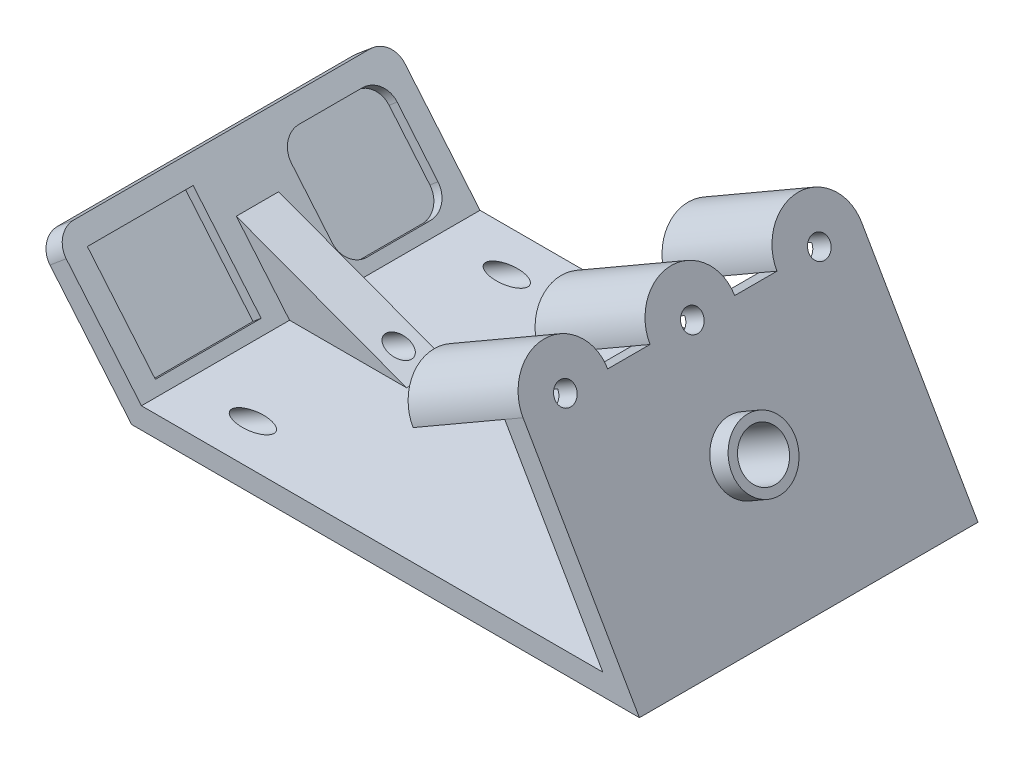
ISO-10303-21;
HEADER;
FILE_DESCRIPTION(('STEP AP214'),'2;1');
FILE_NAME('part.step','',(''),(''),'','','');
FILE_SCHEMA(('AUTOMOTIVE_DESIGN { 1 0 10303 214 1 1 1 1 }'));
ENDSEC;
DATA;
#1=APPLICATION_CONTEXT('core data for automotive mechanical design processes');
#2=APPLICATION_PROTOCOL_DEFINITION('international standard','automotive_design',2000,#1);
#3=PRODUCT_CONTEXT('',#1,'mechanical');
#4=PRODUCT('Part','Part','',(#3));
#5=PRODUCT_RELATED_PRODUCT_CATEGORY('part','',(#4));
#6=PRODUCT_DEFINITION_FORMATION('','',#4);
#7=PRODUCT_DEFINITION_CONTEXT('part definition',#1,'design');
#8=PRODUCT_DEFINITION('design','',#6,#7);
#9=PRODUCT_DEFINITION_SHAPE('','',#8);
#10=(LENGTH_UNIT() NAMED_UNIT(*) SI_UNIT(.MILLI.,.METRE.));
#11=(NAMED_UNIT(*) PLANE_ANGLE_UNIT() SI_UNIT($,.RADIAN.));
#12=(NAMED_UNIT(*) SI_UNIT($,.STERADIAN.) SOLID_ANGLE_UNIT());
#13=UNCERTAINTY_MEASURE_WITH_UNIT(LENGTH_MEASURE(1.E-05),#10,'distance_accuracy_value','');
#14=(GEOMETRIC_REPRESENTATION_CONTEXT(3) GLOBAL_UNCERTAINTY_ASSIGNED_CONTEXT((#13)) GLOBAL_UNIT_ASSIGNED_CONTEXT((#10,
#11,#12)) REPRESENTATION_CONTEXT('',''));
#15=CARTESIAN_POINT('',(0.,0.,0.));
#16=DIRECTION('',(0.,0.,1.));
#17=DIRECTION('',(1.,0.,0.));
#18=AXIS2_PLACEMENT_3D('',#15,#16,#17);
#19=CARTESIAN_POINT('',(66.5192378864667,32.6313972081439,0.));
#20=DIRECTION('',(0.500000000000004,-0.866025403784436,0.));
#21=DIRECTION('',(0.866025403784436,0.500000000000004,0.));
#22=AXIS2_PLACEMENT_3D('',#19,#20,#21);
#23=PLANE('',#22);
#24=DIRECTION('',(0.866025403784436,0.500000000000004,0.));
#25=VECTOR('',#24,1.);
#26=CARTESIAN_POINT('',(-14.3731747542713,-14.071859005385,-12.5));
#27=LINE('',#26,#25);
#28=CARTESIAN_POINT('',(66.5192378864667,32.6313972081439,-12.5));
#29=VERTEX_POINT('',#28);
#30=CARTESIAN_POINT('',(88.1698729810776,45.131397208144,-12.5));
#31=VERTEX_POINT('',#30);
#32=EDGE_CURVE('E407',#29,#31,#27,.T.);
#33=ORIENTED_EDGE('',*,*,#32,.F.);
#34=DIRECTION('',(0.,0.,-1.));
#35=VECTOR('',#34,1.);
#36=CARTESIAN_POINT('',(66.5192378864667,32.6313972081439,0.));
#37=LINE('',#36,#35);
#38=CARTESIAN_POINT('',(66.5192378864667,32.6313972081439,-20.));
#39=VERTEX_POINT('',#38);
#40=EDGE_CURVE('E425',#29,#39,#37,.T.);
#41=ORIENTED_EDGE('',*,*,#40,.T.);
#42=DIRECTION('',(0.866025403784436,0.500000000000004,0.));
#43=VECTOR('',#42,1.);
#44=CARTESIAN_POINT('',(66.5192378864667,32.6313972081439,-20.));
#45=LINE('',#44,#43);
#46=CARTESIAN_POINT('',(88.1698729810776,45.131397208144,-20.));
#47=VERTEX_POINT('',#46);
#48=EDGE_CURVE('E426',#39,#47,#45,.T.);
#49=ORIENTED_EDGE('',*,*,#48,.T.);
#50=DIRECTION('',(0.,0.,-1.));
#51=VECTOR('',#50,1.);
#52=CARTESIAN_POINT('',(88.1698729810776,45.131397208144,-80.));
#53=LINE('',#52,#51);
#54=EDGE_CURVE('E468',#31,#47,#53,.T.);
#55=ORIENTED_EDGE('',*,*,#54,.F.);
#56=EDGE_LOOP('',(#33,#41,#49,#55));
#57=FACE_BOUND('',#56,.T.);
#58=ADVANCED_FACE('F43',(#57),#23,.T.);
#59=CARTESIAN_POINT('',(66.5192378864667,32.6313972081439,-60.));
#60=DIRECTION('',(0.500000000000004,-0.866025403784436,0.));
#61=DIRECTION('',(0.866025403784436,0.500000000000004,0.));
#62=AXIS2_PLACEMENT_3D('',#59,#60,#61);
#63=PLANE('',#62);
#64=DIRECTION('',(0.866025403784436,0.500000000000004,0.));
#65=VECTOR('',#64,1.);
#66=CARTESIAN_POINT('',(-14.3731747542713,-14.071859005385,-72.5));
#67=LINE('',#66,#65);
#68=CARTESIAN_POINT('',(66.5192378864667,32.6313972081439,-72.5));
#69=VERTEX_POINT('',#68);
#70=CARTESIAN_POINT('',(88.1698729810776,45.131397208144,-72.5));
#71=VERTEX_POINT('',#70);
#72=EDGE_CURVE('E394',#69,#71,#67,.T.);
#73=ORIENTED_EDGE('',*,*,#72,.F.);
#74=DIRECTION('',(0.,0.,-1.));
#75=VECTOR('',#74,1.);
#76=CARTESIAN_POINT('',(66.5192378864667,32.6313972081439,-60.));
#77=LINE('',#76,#75);
#78=CARTESIAN_POINT('',(66.5192378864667,32.6313972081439,-80.));
#79=VERTEX_POINT('',#78);
#80=EDGE_CURVE('E443',#69,#79,#77,.T.);
#81=ORIENTED_EDGE('',*,*,#80,.T.);
#82=DIRECTION('',(0.866025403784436,0.500000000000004,0.));
#83=VECTOR('',#82,1.);
#84=CARTESIAN_POINT('',(66.5192378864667,32.6313972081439,-80.));
#85=LINE('',#84,#83);
#86=CARTESIAN_POINT('',(88.1698729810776,45.131397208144,-80.));
#87=VERTEX_POINT('',#86);
#88=EDGE_CURVE('E421',#79,#87,#85,.T.);
#89=ORIENTED_EDGE('',*,*,#88,.T.);
#90=DIRECTION('',(0.,0.,1.));
#91=VECTOR('',#90,1.);
#92=CARTESIAN_POINT('',(88.1698729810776,45.131397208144,-80.));
#93=LINE('',#92,#91);
#94=EDGE_CURVE('E539',#87,#71,#93,.T.);
#95=ORIENTED_EDGE('',*,*,#94,.T.);
#96=EDGE_LOOP('',(#73,#81,#89,#95));
#97=FACE_BOUND('',#96,.T.);
#98=ADVANCED_FACE('F664',(#97),#63,.T.);
#99=CARTESIAN_POINT('',(66.5192378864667,32.6313972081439,-30.));
#100=DIRECTION('',(0.500000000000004,-0.866025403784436,0.));
#101=DIRECTION('',(0.866025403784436,0.500000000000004,0.));
#102=AXIS2_PLACEMENT_3D('',#99,#100,#101);
#103=PLANE('',#102);
#104=DIRECTION('',(0.866025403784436,0.500000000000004,0.));
#105=VECTOR('',#104,1.);
#106=CARTESIAN_POINT('',(-14.3731747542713,-14.071859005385,-42.5));
#107=LINE('',#106,#105);
#108=CARTESIAN_POINT('',(66.5192378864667,32.6313972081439,-42.5));
#109=VERTEX_POINT('',#108);
#110=CARTESIAN_POINT('',(88.1698729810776,45.131397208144,-42.5));
#111=VERTEX_POINT('',#110);
#112=EDGE_CURVE('E381',#109,#111,#107,.T.);
#113=ORIENTED_EDGE('',*,*,#112,.F.);
#114=DIRECTION('',(0.,0.,-1.));
#115=VECTOR('',#114,1.);
#116=CARTESIAN_POINT('',(66.5192378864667,32.6313972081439,-30.));
#117=LINE('',#116,#115);
#118=CARTESIAN_POINT('',(66.5192378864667,32.6313972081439,-50.));
#119=VERTEX_POINT('',#118);
#120=EDGE_CURVE('E459',#109,#119,#117,.T.);
#121=ORIENTED_EDGE('',*,*,#120,.T.);
#122=DIRECTION('',(0.866025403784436,0.500000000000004,0.));
#123=VECTOR('',#122,1.);
#124=CARTESIAN_POINT('',(66.5192378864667,32.6313972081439,-50.));
#125=LINE('',#124,#123);
#126=CARTESIAN_POINT('',(88.1698729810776,45.131397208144,-50.));
#127=VERTEX_POINT('',#126);
#128=EDGE_CURVE('E465',#119,#127,#125,.T.);
#129=ORIENTED_EDGE('',*,*,#128,.T.);
#130=EDGE_CURVE('E820',#127,#111,#93,.T.);
#131=ORIENTED_EDGE('',*,*,#130,.T.);
#132=EDGE_LOOP('',(#113,#121,#129,#131));
#133=FACE_BOUND('',#132,.T.);
#134=ADVANCED_FACE('F672',(#133),#103,.T.);
#135=CARTESIAN_POINT('',(88.1698729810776,45.131397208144,-80.));
#136=DIRECTION('',(0.500000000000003,-0.866025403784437,0.));
#137=DIRECTION('',(0.866025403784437,0.500000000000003,0.));
#138=AXIS2_PLACEMENT_3D('',#135,#136,#137);
#139=PLANE('',#138);
#140=DIRECTION('',(0.,0.,1.));
#141=VECTOR('',#140,1.);
#142=CARTESIAN_POINT('',(92.4999999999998,47.631397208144,-80.));
#143=LINE('',#142,#141);
#144=CARTESIAN_POINT('',(92.4999999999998,47.631397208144,-60.));
#145=VERTEX_POINT('',#144);
#146=CARTESIAN_POINT('',(92.4999999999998,47.631397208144,-50.));
#147=VERTEX_POINT('',#146);
#148=EDGE_CURVE('E546',#145,#147,#143,.T.);
#149=ORIENTED_EDGE('',*,*,#148,.F.);
#150=DIRECTION('',(0.866025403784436,0.500000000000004,0.));
#151=VECTOR('',#150,1.);
#152=CARTESIAN_POINT('',(66.5192378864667,32.6313972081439,-60.));
#153=LINE('',#152,#151);
#154=CARTESIAN_POINT('',(88.1698729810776,45.131397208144,-60.));
#155=VERTEX_POINT('',#154);
#156=EDGE_CURVE('E444',#155,#145,#153,.T.);
#157=ORIENTED_EDGE('',*,*,#156,.F.);
#158=EDGE_CURVE('E543',#155,#127,#93,.T.);
#159=ORIENTED_EDGE('',*,*,#158,.T.);
#160=DIRECTION('',(0.866025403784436,0.500000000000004,0.));
#161=VECTOR('',#160,1.);
#162=CARTESIAN_POINT('',(66.5192378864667,32.6313972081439,-50.));
#163=LINE('',#162,#161);
#164=EDGE_CURVE('E556',#127,#147,#163,.T.);
#165=ORIENTED_EDGE('',*,*,#164,.T.);
#166=EDGE_LOOP('',(#149,#157,#159,#165));
#167=FACE_BOUND('',#166,.T.);
#168=ADVANCED_FACE('F816',(#167),#139,.F.);
#169=CARTESIAN_POINT('',(120.,0.,-80.));
#170=DIRECTION('',(0.866025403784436,0.500000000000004,0.));
#171=DIRECTION('',(-0.500000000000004,0.866025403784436,0.));
#172=AXIS2_PLACEMENT_3D('',#169,#170,#171);
#173=PLANE('',#172);
#174=CARTESIAN_POINT('',(105.,25.9807621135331,-40.));
#175=DIRECTION('',(0.866025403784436,0.500000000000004,0.));
#176=DIRECTION('',(-0.500000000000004,0.866025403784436,0.));
#177=AXIS2_PLACEMENT_3D('',#174,#175,#176);
#178=CIRCLE('',#177,7.5);
#179=CARTESIAN_POINT('',(101.25,32.4759526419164,-40.));
#180=VERTEX_POINT('',#179);
#181=EDGE_CURVE('E365',#180,#180,#178,.T.);
#182=ORIENTED_EDGE('',*,*,#181,.F.);
#183=EDGE_LOOP('',(#182));
#184=FACE_BOUND('',#183,.T.);
#185=CARTESIAN_POINT('',(92.4999999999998,47.631397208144,-10.));
#186=DIRECTION('',(0.866025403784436,0.500000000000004,0.));
#187=DIRECTION('',(-0.500000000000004,0.866025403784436,0.));
#188=AXIS2_PLACEMENT_3D('',#185,#186,#187);
#189=CIRCLE('',#188,2.5);
#190=CARTESIAN_POINT('',(91.2499999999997,49.7964607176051,-10.));
#191=VERTEX_POINT('',#190);
#192=EDGE_CURVE('E370',#191,#191,#189,.T.);
#193=ORIENTED_EDGE('',*,*,#192,.F.);
#194=EDGE_LOOP('',(#193));
#195=FACE_BOUND('',#194,.T.);
#196=CARTESIAN_POINT('',(92.4999999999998,47.631397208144,-70.));
#197=DIRECTION('',(0.866025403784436,0.500000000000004,0.));
#198=DIRECTION('',(-0.500000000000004,0.866025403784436,0.));
#199=AXIS2_PLACEMENT_3D('',#196,#197,#198);
#200=CIRCLE('',#199,2.50000000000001);
#201=CARTESIAN_POINT('',(91.2499999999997,49.7964607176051,-70.));
#202=VERTEX_POINT('',#201);
#203=EDGE_CURVE('E377',#202,#202,#200,.T.);
#204=ORIENTED_EDGE('',*,*,#203,.F.);
#205=EDGE_LOOP('',(#204));
#206=FACE_BOUND('',#205,.T.);
#207=CARTESIAN_POINT('',(92.4999999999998,47.631397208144,-40.));
#208=DIRECTION('',(0.866025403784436,0.500000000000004,0.));
#209=DIRECTION('',(-0.500000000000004,0.866025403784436,0.));
#210=AXIS2_PLACEMENT_3D('',#207,#208,#209);
#211=CIRCLE('',#210,2.5);
#212=CARTESIAN_POINT('',(91.2499999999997,49.7964607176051,-40.));
#213=VERTEX_POINT('',#212);
#214=EDGE_CURVE('E374',#213,#213,#211,.T.);
#215=ORIENTED_EDGE('',*,*,#214,.F.);
#216=EDGE_LOOP('',(#215));
#217=FACE_BOUND('',#216,.T.);
#218=DIRECTION('',(-0.500000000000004,0.866025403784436,0.));
#219=VECTOR('',#218,1.);
#220=CARTESIAN_POINT('',(120.,0.,0.));
#221=LINE('',#220,#219);
#222=CARTESIAN_POINT('',(120.,0.,0.));
#223=VERTEX_POINT('',#222);
#224=CARTESIAN_POINT('',(92.4999999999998,47.631397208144,0.));
#225=VERTEX_POINT('',#224);
#226=EDGE_CURVE('E487',#223,#225,#221,.T.);
#227=ORIENTED_EDGE('',*,*,#226,.F.);
#228=DIRECTION('',(0.,0.,1.));
#229=VECTOR('',#228,1.);
#230=CARTESIAN_POINT('',(120.,0.,-80.));
#231=LINE('',#230,#229);
#232=CARTESIAN_POINT('',(120.,0.,-80.));
#233=VERTEX_POINT('',#232);
#234=EDGE_CURVE('E522',#233,#223,#231,.T.);
#235=ORIENTED_EDGE('',*,*,#234,.F.);
#236=DIRECTION('',(-0.500000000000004,0.866025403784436,0.));
#237=VECTOR('',#236,1.);
#238=CARTESIAN_POINT('',(120.,0.,-80.));
#239=LINE('',#238,#237);
#240=CARTESIAN_POINT('',(92.4999999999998,47.631397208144,-80.));
#241=VERTEX_POINT('',#240);
#242=EDGE_CURVE('E488',#233,#241,#239,.T.);
#243=ORIENTED_EDGE('',*,*,#242,.T.);
#244=CARTESIAN_POINT('',(92.4999999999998,47.631397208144,-70.));
#245=DIRECTION('',(0.866025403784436,0.500000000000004,0.));
#246=DIRECTION('',(-0.500000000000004,0.866025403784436,0.));
#247=AXIS2_PLACEMENT_3D('',#244,#245,#246);
#248=CIRCLE('',#247,10.);
#249=EDGE_CURVE('E447',#241,#145,#248,.T.);
#250=ORIENTED_EDGE('',*,*,#249,.T.);
#251=ORIENTED_EDGE('',*,*,#148,.T.);
#252=CARTESIAN_POINT('',(92.4999999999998,47.631397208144,-40.));
#253=DIRECTION('',(0.866025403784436,0.500000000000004,0.));
#254=DIRECTION('',(0.500000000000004,-0.866025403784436,0.));
#255=AXIS2_PLACEMENT_3D('',#252,#253,#254);
#256=CIRCLE('',#255,10.);
#257=CARTESIAN_POINT('',(92.4999999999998,47.631397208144,-30.));
#258=VERTEX_POINT('',#257);
#259=EDGE_CURVE('E433',#147,#258,#256,.T.);
#260=ORIENTED_EDGE('',*,*,#259,.T.);
#261=CARTESIAN_POINT('',(92.4999999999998,47.631397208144,-20.));
#262=VERTEX_POINT('',#261);
#263=EDGE_CURVE('E507',#258,#262,#143,.T.);
#264=ORIENTED_EDGE('',*,*,#263,.T.);
#265=CARTESIAN_POINT('',(92.4999999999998,47.631397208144,-10.));
#266=DIRECTION('',(0.866025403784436,0.500000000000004,0.));
#267=DIRECTION('',(0.500000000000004,-0.866025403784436,0.));
#268=AXIS2_PLACEMENT_3D('',#265,#266,#267);
#269=CIRCLE('',#268,10.);
#270=EDGE_CURVE('E430',#262,#225,#269,.T.);
#271=ORIENTED_EDGE('',*,*,#270,.T.);
#272=EDGE_LOOP('',(#227,#235,#243,#250,#251,#260,#264,#271));
#273=FACE_BOUND('',#272,.T.);
#274=ADVANCED_FACE('F712',(#184,#195,#206,#217,#273),#173,.T.);
#275=CARTESIAN_POINT('',(0.,0.,-80.));
#276=DIRECTION('',(0.,-1.,0.));
#277=DIRECTION('',(0.,0.,-1.));
#278=AXIS2_PLACEMENT_3D('',#275,#276,#277);
#279=PLANE('',#278);
#280=CARTESIAN_POINT('',(10.0000000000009,0.,-10.));
#281=DIRECTION('',(0.,-1.,0.));
#282=DIRECTION('',(1.,0.,0.));
#283=AXIS2_PLACEMENT_3D('',#280,#281,#282);
#284=ELLIPSE('',#283,4.99999999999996,2.5);
#285=CARTESIAN_POINT('',(15.0000000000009,0.,-10.));
#286=VERTEX_POINT('',#285);
#287=EDGE_CURVE('E415',#286,#286,#284,.T.);
#288=ORIENTED_EDGE('',*,*,#287,.F.);
#289=EDGE_LOOP('',(#288));
#290=FACE_BOUND('',#289,.T.);
#291=CARTESIAN_POINT('',(60.0000000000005,0.,-40.));
#292=DIRECTION('',(0.,-1.,0.));
#293=DIRECTION('',(1.,0.,0.));
#294=AXIS2_PLACEMENT_3D('',#291,#292,#293);
#295=ELLIPSE('',#294,10.9999999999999,5.5);
#296=CARTESIAN_POINT('',(71.0000000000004,0.,-40.));
#297=VERTEX_POINT('',#296);
#298=EDGE_CURVE('E418',#297,#297,#295,.T.);
#299=ORIENTED_EDGE('',*,*,#298,.F.);
#300=EDGE_LOOP('',(#299));
#301=FACE_BOUND('',#300,.T.);
#302=CARTESIAN_POINT('',(10.0000000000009,0.,-70.));
#303=DIRECTION('',(0.,-1.,0.));
#304=DIRECTION('',(1.,0.,0.));
#305=AXIS2_PLACEMENT_3D('',#302,#303,#304);
#306=ELLIPSE('',#305,4.99999999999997,2.50000000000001);
#307=CARTESIAN_POINT('',(15.0000000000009,0.,-70.));
#308=VERTEX_POINT('',#307);
#309=EDGE_CURVE('E402',#308,#308,#306,.T.);
#310=ORIENTED_EDGE('',*,*,#309,.F.);
#311=EDGE_LOOP('',(#310));
#312=FACE_BOUND('',#311,.T.);
#313=CARTESIAN_POINT('',(10.0000000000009,0.,-40.));
#314=DIRECTION('',(0.,-1.,0.));
#315=DIRECTION('',(1.,0.,0.));
#316=AXIS2_PLACEMENT_3D('',#313,#314,#315);
#317=ELLIPSE('',#316,4.99999999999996,2.5);
#318=CARTESIAN_POINT('',(15.0000000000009,0.,-40.));
#319=VERTEX_POINT('',#318);
#320=EDGE_CURVE('E389',#319,#319,#317,.T.);
#321=ORIENTED_EDGE('',*,*,#320,.F.);
#322=EDGE_LOOP('',(#321));
#323=FACE_BOUND('',#322,.T.);
#324=DIRECTION('',(1.,0.,0.));
#325=VECTOR('',#324,1.);
#326=CARTESIAN_POINT('',(0.,0.,0.));
#327=LINE('',#326,#325);
#328=CARTESIAN_POINT('',(0.,0.,0.));
#329=VERTEX_POINT('',#328);
#330=EDGE_CURVE('E492',#329,#223,#327,.T.);
#331=ORIENTED_EDGE('',*,*,#330,.F.);
#332=DIRECTION('',(0.,0.,1.));
#333=VECTOR('',#332,1.);
#334=CARTESIAN_POINT('',(0.,0.,-80.));
#335=LINE('',#334,#333);
#336=CARTESIAN_POINT('',(0.,0.,-80.));
#337=VERTEX_POINT('',#336);
#338=EDGE_CURVE('E525',#337,#329,#335,.T.);
#339=ORIENTED_EDGE('',*,*,#338,.F.);
#340=DIRECTION('',(1.,0.,0.));
#341=VECTOR('',#340,1.);
#342=CARTESIAN_POINT('',(0.,0.,-80.));
#343=LINE('',#342,#341);
#344=EDGE_CURVE('E504',#337,#233,#343,.T.);
#345=ORIENTED_EDGE('',*,*,#344,.T.);
#346=ORIENTED_EDGE('',*,*,#234,.T.);
#347=EDGE_LOOP('',(#331,#339,#345,#346));
#348=FACE_BOUND('',#347,.T.);
#349=ADVANCED_FACE('F799',(#290,#301,#312,#323,#348),#279,.T.);
#350=CARTESIAN_POINT('',(-22.4975663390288,26.8115555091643,-80.));
#351=DIRECTION('',(-0.766044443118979,-0.642787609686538,0.));
#352=DIRECTION('',(0.642787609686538,-0.76604444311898,0.));
#353=AXIS2_PLACEMENT_3D('',#350,#351,#352);
#354=PLANE('',#353);
#355=DIRECTION('',(0.,0.,1.));
#356=VECTOR('',#355,1.);
#357=CARTESIAN_POINT('',(-22.4975663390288,26.8115555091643,-80.));
#358=LINE('',#357,#356);
#359=CARTESIAN_POINT('',(-22.4975663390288,26.8115555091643,-75.));
#360=VERTEX_POINT('',#359);
#361=CARTESIAN_POINT('',(-22.4975663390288,26.8115555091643,-5.));
#362=VERTEX_POINT('',#361);
#363=EDGE_CURVE('E528',#360,#362,#358,.T.);
#364=ORIENTED_EDGE('',*,*,#363,.F.);
#365=CARTESIAN_POINT('',(-19.2836282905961,22.9813332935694,-75.));
#366=DIRECTION('',(-0.766044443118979,-0.642787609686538,0.));
#367=DIRECTION('',(0.642787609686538,-0.76604444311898,0.));
#368=AXIS2_PLACEMENT_3D('',#365,#366,#367);
#369=CIRCLE('',#368,5.);
#370=CARTESIAN_POINT('',(-19.2836282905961,22.9813332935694,-80.));
#371=VERTEX_POINT('',#370);
#372=EDGE_CURVE('E607',#360,#371,#369,.T.);
#373=ORIENTED_EDGE('',*,*,#372,.T.);
#374=DIRECTION('',(0.642787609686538,-0.766044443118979,0.));
#375=VECTOR('',#374,1.);
#376=CARTESIAN_POINT('',(-22.4975663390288,26.8115555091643,-80.));
#377=LINE('',#376,#375);
#378=EDGE_CURVE('E502',#371,#337,#377,.T.);
#379=ORIENTED_EDGE('',*,*,#378,.T.);
#380=ORIENTED_EDGE('',*,*,#338,.T.);
#381=DIRECTION('',(0.642787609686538,-0.766044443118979,0.));
#382=VECTOR('',#381,1.);
#383=CARTESIAN_POINT('',(-22.4975663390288,26.8115555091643,0.));
#384=LINE('',#383,#382);
#385=CARTESIAN_POINT('',(-19.2836282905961,22.9813332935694,0.));
#386=VERTEX_POINT('',#385);
#387=EDGE_CURVE('E518',#386,#329,#384,.T.);
#388=ORIENTED_EDGE('',*,*,#387,.F.);
#389=CARTESIAN_POINT('',(-19.2836282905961,22.9813332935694,-5.));
#390=DIRECTION('',(-0.766044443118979,-0.642787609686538,0.));
#391=DIRECTION('',(0.642787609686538,-0.76604444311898,0.));
#392=AXIS2_PLACEMENT_3D('',#389,#390,#391);
#393=CIRCLE('',#392,5.);
#394=EDGE_CURVE('E65',#386,#362,#393,.T.);
#395=ORIENTED_EDGE('',*,*,#394,.T.);
#396=EDGE_LOOP('',(#364,#373,#379,#380,#388,#395));
#397=FACE_BOUND('',#396,.T.);
#398=ADVANCED_FACE('F796',(#397),#354,.T.);
#399=CARTESIAN_POINT('',(-22.4975663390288,26.8115555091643,-80.));
#400=DIRECTION('',(0.642787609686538,-0.766044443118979,0.));
#401=DIRECTION('',(0.766044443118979,0.642787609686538,0.));
#402=AXIS2_PLACEMENT_3D('',#399,#400,#401);
#403=PLANE('',#402);
#404=DIRECTION('',(0.,0.,1.));
#405=VECTOR('',#404,1.);
#406=CARTESIAN_POINT('',(-18.6673441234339,30.025493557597,-80.));
#407=LINE('',#406,#405);
#408=CARTESIAN_POINT('',(-18.6673441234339,30.025493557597,-75.));
#409=VERTEX_POINT('',#408);
#410=CARTESIAN_POINT('',(-18.6673441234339,30.025493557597,-5.));
#411=VERTEX_POINT('',#410);
#412=EDGE_CURVE('E530',#409,#411,#407,.T.);
#413=ORIENTED_EDGE('',*,*,#412,.F.);
#414=DIRECTION('',(0.766044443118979,0.642787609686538,0.));
#415=VECTOR('',#414,1.);
#416=CARTESIAN_POINT('',(-22.4975663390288,26.8115555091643,-75.));
#417=LINE('',#416,#415);
#418=EDGE_CURVE('E604',#409,#360,#417,.F.);
#419=ORIENTED_EDGE('',*,*,#418,.T.);
#420=ORIENTED_EDGE('',*,*,#363,.T.);
#421=DIRECTION('',(0.766044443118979,0.642787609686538,0.));
#422=VECTOR('',#421,1.);
#423=CARTESIAN_POINT('',(-22.4975663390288,26.8115555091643,-5.));
#424=LINE('',#423,#422);
#425=EDGE_CURVE('E601',#362,#411,#424,.T.);
#426=ORIENTED_EDGE('',*,*,#425,.T.);
#427=EDGE_LOOP('',(#413,#419,#420,#426));
#428=FACE_BOUND('',#427,.T.);
#429=ADVANCED_FACE('F786',(#428),#403,.F.);
#430=CARTESIAN_POINT('',(-18.6673441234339,30.025493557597,-80.));
#431=DIRECTION('',(-0.766044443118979,-0.642787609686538,0.));
#432=DIRECTION('',(0.642787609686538,-0.766044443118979,0.));
#433=AXIS2_PLACEMENT_3D('',#430,#431,#432);
#434=PLANE('',#433);
#435=DIRECTION('',(0.642787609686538,-0.76604444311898,0.));
#436=VECTOR('',#435,1.);
#437=CARTESIAN_POINT('',(0.616284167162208,7.04416026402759,-5.));
#438=LINE('',#437,#436);
#439=CARTESIAN_POINT('',(-15.4534060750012,26.1952713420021,-5.00000000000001));
#440=VERTEX_POINT('',#439);
#441=CARTESIAN_POINT('',(0.616284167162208,7.04416026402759,-5.));
#442=VERTEX_POINT('',#441);
#443=EDGE_CURVE('E322',#440,#442,#438,.T.);
#444=ORIENTED_EDGE('',*,*,#443,.F.);
#445=DIRECTION('',(0.,0.,1.));
#446=VECTOR('',#445,1.);
#447=CARTESIAN_POINT('',(-15.4534060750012,26.1952713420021,-5.));
#448=LINE('',#447,#446);
#449=CARTESIAN_POINT('',(-15.4534060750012,26.1952713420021,-30.));
#450=VERTEX_POINT('',#449);
#451=EDGE_CURVE('E296',#450,#440,#448,.T.);
#452=ORIENTED_EDGE('',*,*,#451,.F.);
#453=DIRECTION('',(-0.642787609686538,0.766044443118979,0.));
#454=VECTOR('',#453,1.);
#455=CARTESIAN_POINT('',(0.616284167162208,7.04416026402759,-30.));
#456=LINE('',#455,#454);
#457=CARTESIAN_POINT('',(0.616284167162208,7.04416026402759,-30.));
#458=VERTEX_POINT('',#457);
#459=EDGE_CURVE('E313',#458,#450,#456,.T.);
#460=ORIENTED_EDGE('',*,*,#459,.F.);
#461=DIRECTION('',(0.,0.,-1.));
#462=VECTOR('',#461,1.);
#463=CARTESIAN_POINT('',(0.616284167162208,7.04416026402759,-5.));
#464=LINE('',#463,#462);
#465=EDGE_CURVE('E316',#442,#458,#464,.T.);
#466=ORIENTED_EDGE('',*,*,#465,.F.);
#467=EDGE_LOOP('',(#444,#452,#460,#466));
#468=FACE_BOUND('',#467,.T.);
#469=DIRECTION('',(-0.642787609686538,0.766044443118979,0.));
#470=VECTOR('',#469,1.);
#471=CARTESIAN_POINT('',(0.616284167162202,7.04416026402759,-75.));
#472=LINE('',#471,#470);
#473=CARTESIAN_POINT('',(-2.59765388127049,10.8743824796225,-75.));
#474=VERTEX_POINT('',#473);
#475=CARTESIAN_POINT('',(-12.2394680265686,22.3650491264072,-75.));
#476=VERTEX_POINT('',#475);
#477=EDGE_CURVE('E340',#474,#476,#472,.T.);
#478=ORIENTED_EDGE('',*,*,#477,.F.);
#479=CARTESIAN_POINT('',(-2.59765388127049,10.8743824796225,-70.));
#480=DIRECTION('',(-0.766044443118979,-0.642787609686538,0.));
#481=DIRECTION('',(0.642787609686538,-0.766044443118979,0.));
#482=AXIS2_PLACEMENT_3D('',#479,#480,#481);
#483=CIRCLE('',#482,5.);
#484=CARTESIAN_POINT('',(0.616284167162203,7.04416026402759,-70.));
#485=VERTEX_POINT('',#484);
#486=EDGE_CURVE('E610',#474,#485,#483,.T.);
#487=ORIENTED_EDGE('',*,*,#486,.T.);
#488=DIRECTION('',(0.,0.,-1.));
#489=VECTOR('',#488,1.);
#490=CARTESIAN_POINT('',(0.616284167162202,7.04416026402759,-75.));
#491=LINE('',#490,#489);
#492=CARTESIAN_POINT('',(0.616284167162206,7.04416026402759,-55.));
#493=VERTEX_POINT('',#492);
#494=EDGE_CURVE('E323',#493,#485,#491,.T.);
#495=ORIENTED_EDGE('',*,*,#494,.F.);
#496=CARTESIAN_POINT('',(-2.59765388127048,10.8743824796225,-55.));
#497=DIRECTION('',(-0.766044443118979,-0.642787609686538,0.));
#498=DIRECTION('',(0.642787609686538,-0.766044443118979,0.));
#499=AXIS2_PLACEMENT_3D('',#496,#497,#498);
#500=CIRCLE('',#499,5.);
#501=CARTESIAN_POINT('',(-2.59765388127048,10.8743824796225,-50.));
#502=VERTEX_POINT('',#501);
#503=EDGE_CURVE('E612',#493,#502,#500,.T.);
#504=ORIENTED_EDGE('',*,*,#503,.T.);
#505=DIRECTION('',(0.642787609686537,-0.766044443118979,0.));
#506=VECTOR('',#505,1.);
#507=CARTESIAN_POINT('',(0.616284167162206,7.04416026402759,-50.));
#508=LINE('',#507,#506);
#509=CARTESIAN_POINT('',(-12.2394680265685,22.3650491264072,-50.));
#510=VERTEX_POINT('',#509);
#511=EDGE_CURVE('E333',#510,#502,#508,.T.);
#512=ORIENTED_EDGE('',*,*,#511,.F.);
#513=CARTESIAN_POINT('',(-12.2394680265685,22.3650491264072,-55.));
#514=DIRECTION('',(-0.766044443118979,-0.642787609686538,0.));
#515=DIRECTION('',(0.642787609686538,-0.766044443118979,0.));
#516=AXIS2_PLACEMENT_3D('',#513,#514,#515);
#517=CIRCLE('',#516,5.);
#518=CARTESIAN_POINT('',(-15.4534060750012,26.1952713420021,-55.));
#519=VERTEX_POINT('',#518);
#520=EDGE_CURVE('E51',#510,#519,#517,.T.);
#521=ORIENTED_EDGE('',*,*,#520,.T.);
#522=DIRECTION('',(0.,0.,1.));
#523=VECTOR('',#522,1.);
#524=CARTESIAN_POINT('',(-15.4534060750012,26.1952713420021,-75.));
#525=LINE('',#524,#523);
#526=CARTESIAN_POINT('',(-15.4534060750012,26.1952713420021,-70.));
#527=VERTEX_POINT('',#526);
#528=EDGE_CURVE('E336',#527,#519,#525,.T.);
#529=ORIENTED_EDGE('',*,*,#528,.F.);
#530=CARTESIAN_POINT('',(-12.2394680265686,22.3650491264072,-70.));
#531=DIRECTION('',(-0.766044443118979,-0.642787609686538,0.));
#532=DIRECTION('',(0.642787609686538,-0.766044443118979,0.));
#533=AXIS2_PLACEMENT_3D('',#530,#531,#532);
#534=CIRCLE('',#533,5.);
#535=EDGE_CURVE('E11',#527,#476,#534,.T.);
#536=ORIENTED_EDGE('',*,*,#535,.T.);
#537=EDGE_LOOP('',(#478,#487,#495,#504,#512,#521,#529,#536));
#538=FACE_BOUND('',#537,.T.);
#539=DIRECTION('',(0.642787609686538,-0.76604444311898,0.));
#540=VECTOR('',#539,1.);
#541=CARTESIAN_POINT('',(-18.6673441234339,30.025493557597,-80.));
#542=LINE('',#541,#540);
#543=CARTESIAN_POINT('',(-15.4534060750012,26.1952713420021,-80.));
#544=VERTEX_POINT('',#543);
#545=CARTESIAN_POINT('',(2.331538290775,5.,-80.));
#546=VERTEX_POINT('',#545);
#547=EDGE_CURVE('E500',#544,#546,#542,.T.);
#548=ORIENTED_EDGE('',*,*,#547,.F.);
#549=CARTESIAN_POINT('',(-15.4534060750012,26.1952713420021,-75.));
#550=DIRECTION('',(-0.766044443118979,-0.642787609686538,0.));
#551=DIRECTION('',(0.642787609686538,-0.766044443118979,0.));
#552=AXIS2_PLACEMENT_3D('',#549,#550,#551);
#553=CIRCLE('',#552,5.);
#554=EDGE_CURVE('E599',#544,#409,#553,.F.);
#555=ORIENTED_EDGE('',*,*,#554,.T.);
#556=ORIENTED_EDGE('',*,*,#412,.T.);
#557=CARTESIAN_POINT('',(-15.4534060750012,26.1952713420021,-5.));
#558=DIRECTION('',(-0.766044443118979,-0.642787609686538,0.));
#559=DIRECTION('',(0.642787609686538,-0.766044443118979,0.));
#560=AXIS2_PLACEMENT_3D('',#557,#558,#559);
#561=CIRCLE('',#560,5.);
#562=CARTESIAN_POINT('',(-15.4534060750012,26.1952713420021,0.));
#563=VERTEX_POINT('',#562);
#564=EDGE_CURVE('E597',#411,#563,#561,.F.);
#565=ORIENTED_EDGE('',*,*,#564,.T.);
#566=DIRECTION('',(0.642787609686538,-0.76604444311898,0.));
#567=VECTOR('',#566,1.);
#568=CARTESIAN_POINT('',(-18.6673441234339,30.025493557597,0.));
#569=LINE('',#568,#567);
#570=CARTESIAN_POINT('',(2.331538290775,5.,0.));
#571=VERTEX_POINT('',#570);
#572=EDGE_CURVE('E516',#563,#571,#569,.T.);
#573=ORIENTED_EDGE('',*,*,#572,.T.);
#574=DIRECTION('',(0.,0.,1.));
#575=VECTOR('',#574,1.);
#576=CARTESIAN_POINT('',(2.331538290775,5.,-80.));
#577=LINE('',#576,#575);
#578=CARTESIAN_POINT('',(2.331538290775,5.,-35.));
#579=VERTEX_POINT('',#578);
#580=EDGE_CURVE('E535',#579,#571,#577,.T.);
#581=ORIENTED_EDGE('',*,*,#580,.F.);
#582=DIRECTION('',(-0.642787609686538,0.766044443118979,0.));
#583=VECTOR('',#582,1.);
#584=CARTESIAN_POINT('',(-18.6673441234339,30.025493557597,-35.));
#585=LINE('',#584,#583);
#586=CARTESIAN_POINT('',(-10.2549561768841,20.,-35.));
#587=VERTEX_POINT('',#586);
#588=EDGE_CURVE('E483',#579,#587,#585,.T.);
#589=ORIENTED_EDGE('',*,*,#588,.T.);
#590=DIRECTION('',(0.,0.,1.));
#591=VECTOR('',#590,1.);
#592=CARTESIAN_POINT('',(-10.2549561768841,20.,-80.));
#593=LINE('',#592,#591);
#594=CARTESIAN_POINT('',(-10.2549561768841,20.,-45.));
#595=VERTEX_POINT('',#594);
#596=EDGE_CURVE('E485',#587,#595,#593,.F.);
#597=ORIENTED_EDGE('',*,*,#596,.T.);
#598=DIRECTION('',(-0.642787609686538,0.766044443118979,0.));
#599=VECTOR('',#598,1.);
#600=CARTESIAN_POINT('',(-18.6673441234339,30.025493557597,-45.));
#601=LINE('',#600,#599);
#602=CARTESIAN_POINT('',(2.331538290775,5.,-45.));
#603=VERTEX_POINT('',#602);
#604=EDGE_CURVE('E478',#603,#595,#601,.T.);
#605=ORIENTED_EDGE('',*,*,#604,.F.);
#606=EDGE_CURVE('E533',#546,#603,#577,.T.);
#607=ORIENTED_EDGE('',*,*,#606,.F.);
#608=EDGE_LOOP('',(#548,#555,#556,#565,#573,#581,#589,#597,#605,#607));
#609=FACE_BOUND('',#608,.T.);
#610=ADVANCED_FACE('F617',(#468,#538,#609),#434,.F.);
#611=CARTESIAN_POINT('',(0.,5.,-80.));
#612=DIRECTION('',(0.,-1.,0.));
#613=DIRECTION('',(0.,0.,-1.));
#614=AXIS2_PLACEMENT_3D('',#611,#612,#613);
#615=PLANE('',#614);
#616=CARTESIAN_POINT('',(68.6602540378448,5.,-40.));
#617=DIRECTION('',(0.,-1.,0.));
#618=DIRECTION('',(1.,0.,0.));
#619=AXIS2_PLACEMENT_3D('',#616,#617,#618);
#620=ELLIPSE('',#619,14.9999999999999,7.5);
#621=CARTESIAN_POINT('',(83.6602540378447,5.,-40.));
#622=VERTEX_POINT('',#621);
#623=EDGE_CURVE('E361',#622,#622,#620,.F.);
#624=ORIENTED_EDGE('',*,*,#623,.F.);
#625=EDGE_LOOP('',(#624));
#626=FACE_BOUND('',#625,.T.);
#627=CARTESIAN_POINT('',(18.6602540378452,5.,-10.));
#628=DIRECTION('',(0.,-1.,0.));
#629=DIRECTION('',(1.,0.,0.));
#630=AXIS2_PLACEMENT_3D('',#627,#628,#629);
#631=ELLIPSE('',#630,4.99999999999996,2.5);
#632=CARTESIAN_POINT('',(23.6602540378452,5.,-10.));
#633=VERTEX_POINT('',#632);
#634=EDGE_CURVE('E412',#633,#633,#631,.T.);
#635=ORIENTED_EDGE('',*,*,#634,.T.);
#636=EDGE_LOOP('',(#635));
#637=FACE_BOUND('',#636,.T.);
#638=CARTESIAN_POINT('',(18.6602540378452,5.,-70.));
#639=DIRECTION('',(0.,-1.,0.));
#640=DIRECTION('',(1.,0.,0.));
#641=AXIS2_PLACEMENT_3D('',#638,#639,#640);
#642=ELLIPSE('',#641,4.99999999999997,2.50000000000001);
#643=CARTESIAN_POINT('',(23.6602540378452,5.,-70.));
#644=VERTEX_POINT('',#643);
#645=EDGE_CURVE('E399',#644,#644,#642,.T.);
#646=ORIENTED_EDGE('',*,*,#645,.T.);
#647=EDGE_LOOP('',(#646));
#648=FACE_BOUND('',#647,.T.);
#649=DIRECTION('',(0.,0.,-1.));
#650=VECTOR('',#649,1.);
#651=CARTESIAN_POINT('',(30.,5.,-80.));
#652=LINE('',#651,#650);
#653=CARTESIAN_POINT('',(30.,5.,-45.));
#654=VERTEX_POINT('',#653);
#655=CARTESIAN_POINT('',(30.,5.,-35.));
#656=VERTEX_POINT('',#655);
#657=EDGE_CURVE('E549',#654,#656,#652,.F.);
#658=ORIENTED_EDGE('',*,*,#657,.T.);
#659=DIRECTION('',(-1.,0.,0.));
#660=VECTOR('',#659,1.);
#661=CARTESIAN_POINT('',(0.,5.,-35.));
#662=LINE('',#661,#660);
#663=EDGE_CURVE('E551',#656,#579,#662,.T.);
#664=ORIENTED_EDGE('',*,*,#663,.T.);
#665=ORIENTED_EDGE('',*,*,#580,.T.);
#666=DIRECTION('',(1.,0.,0.));
#667=VECTOR('',#666,1.);
#668=CARTESIAN_POINT('',(0.,5.,0.));
#669=LINE('',#668,#667);
#670=CARTESIAN_POINT('',(111.339745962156,5.00000000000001,0.));
#671=VERTEX_POINT('',#670);
#672=EDGE_CURVE('E514',#571,#671,#669,.T.);
#673=ORIENTED_EDGE('',*,*,#672,.T.);
#674=DIRECTION('',(0.,0.,1.));
#675=VECTOR('',#674,1.);
#676=CARTESIAN_POINT('',(111.339745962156,5.00000000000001,-80.));
#677=LINE('',#676,#675);
#678=CARTESIAN_POINT('',(111.339745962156,5.00000000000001,-80.));
#679=VERTEX_POINT('',#678);
#680=EDGE_CURVE('E536',#679,#671,#677,.T.);
#681=ORIENTED_EDGE('',*,*,#680,.F.);
#682=DIRECTION('',(1.,0.,0.));
#683=VECTOR('',#682,1.);
#684=CARTESIAN_POINT('',(0.,5.,-80.));
#685=LINE('',#684,#683);
#686=EDGE_CURVE('E498',#546,#679,#685,.T.);
#687=ORIENTED_EDGE('',*,*,#686,.F.);
#688=ORIENTED_EDGE('',*,*,#606,.T.);
#689=DIRECTION('',(-1.,0.,0.));
#690=VECTOR('',#689,1.);
#691=CARTESIAN_POINT('',(0.,5.,-45.));
#692=LINE('',#691,#690);
#693=EDGE_CURVE('E524',#654,#603,#692,.T.);
#694=ORIENTED_EDGE('',*,*,#693,.F.);
#695=EDGE_LOOP('',(#658,#664,#665,#673,#681,#687,#688,#694));
#696=FACE_BOUND('',#695,.T.);
#697=ADVANCED_FACE('F761',(#626,#637,#648,#696),#615,.F.);
#698=CARTESIAN_POINT('',(115.669872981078,-2.50000000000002,-80.));
#699=DIRECTION('',(0.866025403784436,0.500000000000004,0.));
#700=DIRECTION('',(-0.500000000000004,0.866025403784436,0.));
#701=AXIS2_PLACEMENT_3D('',#698,#699,#700);
#702=PLANE('',#701);
#703=CARTESIAN_POINT('',(100.669872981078,23.4807621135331,-40.));
#704=DIRECTION('',(0.866025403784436,0.500000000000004,0.));
#705=DIRECTION('',(-0.500000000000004,0.866025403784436,0.));
#706=AXIS2_PLACEMENT_3D('',#703,#704,#705);
#707=CIRCLE('',#706,7.5);
#708=CARTESIAN_POINT('',(96.9198729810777,29.9759526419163,-40.));
#709=VERTEX_POINT('',#708);
#710=EDGE_CURVE('E364',#709,#709,#707,.T.);
#711=ORIENTED_EDGE('',*,*,#710,.T.);
#712=EDGE_LOOP('',(#711));
#713=FACE_BOUND('',#712,.T.);
#714=CARTESIAN_POINT('',(88.1698729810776,45.131397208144,0.));
#715=VERTEX_POINT('',#714);
#716=CARTESIAN_POINT('',(88.1698729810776,45.131397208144,-7.5));
#717=VERTEX_POINT('',#716);
#718=EDGE_CURVE('E471',#715,#717,#53,.T.);
#719=ORIENTED_EDGE('',*,*,#718,.T.);
#720=CARTESIAN_POINT('',(88.1698729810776,45.131397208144,-10.));
#721=DIRECTION('',(0.866025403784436,0.500000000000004,0.));
#722=DIRECTION('',(-0.500000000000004,0.866025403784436,0.));
#723=AXIS2_PLACEMENT_3D('',#720,#721,#722);
#724=CIRCLE('',#723,2.5);
#725=EDGE_CURVE('E409',#717,#31,#724,.T.);
#726=ORIENTED_EDGE('',*,*,#725,.T.);
#727=ORIENTED_EDGE('',*,*,#54,.T.);
#728=CARTESIAN_POINT('',(88.1698729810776,45.131397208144,-30.));
#729=VERTEX_POINT('',#728);
#730=EDGE_CURVE('E720',#729,#47,#93,.T.);
#731=ORIENTED_EDGE('',*,*,#730,.F.);
#732=CARTESIAN_POINT('',(88.1698729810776,45.131397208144,-37.5));
#733=VERTEX_POINT('',#732);
#734=EDGE_CURVE('E821',#733,#729,#93,.T.);
#735=ORIENTED_EDGE('',*,*,#734,.F.);
#736=CARTESIAN_POINT('',(88.1698729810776,45.131397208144,-40.));
#737=DIRECTION('',(0.866025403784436,0.500000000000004,0.));
#738=DIRECTION('',(-0.500000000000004,0.866025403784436,0.));
#739=AXIS2_PLACEMENT_3D('',#736,#737,#738);
#740=CIRCLE('',#739,2.5);
#741=EDGE_CURVE('E383',#733,#111,#740,.T.);
#742=ORIENTED_EDGE('',*,*,#741,.T.);
#743=ORIENTED_EDGE('',*,*,#130,.F.);
#744=ORIENTED_EDGE('',*,*,#158,.F.);
#745=CARTESIAN_POINT('',(88.1698729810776,45.131397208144,-67.5));
#746=VERTEX_POINT('',#745);
#747=EDGE_CURVE('E542',#746,#155,#93,.T.);
#748=ORIENTED_EDGE('',*,*,#747,.F.);
#749=CARTESIAN_POINT('',(88.1698729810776,45.131397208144,-70.));
#750=DIRECTION('',(0.866025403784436,0.500000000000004,0.));
#751=DIRECTION('',(-0.500000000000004,0.866025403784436,0.));
#752=AXIS2_PLACEMENT_3D('',#749,#750,#751);
#753=CIRCLE('',#752,2.50000000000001);
#754=EDGE_CURVE('E396',#746,#71,#753,.T.);
#755=ORIENTED_EDGE('',*,*,#754,.T.);
#756=ORIENTED_EDGE('',*,*,#94,.F.);
#757=DIRECTION('',(-0.500000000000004,0.866025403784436,0.));
#758=VECTOR('',#757,1.);
#759=CARTESIAN_POINT('',(115.669872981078,-2.50000000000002,-80.));
#760=LINE('',#759,#758);
#761=EDGE_CURVE('E495',#679,#87,#760,.T.);
#762=ORIENTED_EDGE('',*,*,#761,.F.);
#763=ORIENTED_EDGE('',*,*,#680,.T.);
#764=DIRECTION('',(-0.500000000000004,0.866025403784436,0.));
#765=VECTOR('',#764,1.);
#766=CARTESIAN_POINT('',(115.669872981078,-2.50000000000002,0.));
#767=LINE('',#766,#765);
#768=EDGE_CURVE('E512',#671,#715,#767,.T.);
#769=ORIENTED_EDGE('',*,*,#768,.T.);
#770=EDGE_LOOP('',(#719,#726,#727,#731,#735,#742,#743,#744,#748,#755,#756,#762,#763,#769));
#771=FACE_BOUND('',#770,.T.);
#772=ADVANCED_FACE('F700',(#713,#771),#702,.F.);
#773=ORIENTED_EDGE('',*,*,#730,.T.);
#774=EDGE_CURVE('E429',#47,#262,#45,.T.);
#775=ORIENTED_EDGE('',*,*,#774,.T.);
#776=ORIENTED_EDGE('',*,*,#263,.F.);
#777=DIRECTION('',(0.866025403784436,0.500000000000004,0.));
#778=VECTOR('',#777,1.);
#779=CARTESIAN_POINT('',(66.5192378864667,32.6313972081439,-30.));
#780=LINE('',#779,#778);
#781=EDGE_CURVE('E553',#258,#729,#780,.F.);
#782=ORIENTED_EDGE('',*,*,#781,.T.);
#783=EDGE_LOOP('',(#773,#775,#776,#782));
#784=FACE_BOUND('',#783,.T.);
#785=ADVANCED_FACE('F718',(#784),#139,.F.);
#786=CARTESIAN_POINT('',(0.,0.,-80.));
#787=DIRECTION('',(0.,0.,-1.));
#788=DIRECTION('',(-1.,0.,0.));
#789=AXIS2_PLACEMENT_3D('',#786,#787,#788);
#790=PLANE('',#789);
#791=ORIENTED_EDGE('',*,*,#378,.F.);
#792=DIRECTION('',(0.766044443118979,0.642787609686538,0.));
#793=VECTOR('',#792,1.);
#794=CARTESIAN_POINT('',(-15.4534060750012,26.1952713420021,-80.));
#795=LINE('',#794,#793);
#796=EDGE_CURVE('E594',#371,#544,#795,.T.);
#797=ORIENTED_EDGE('',*,*,#796,.T.);
#798=ORIENTED_EDGE('',*,*,#547,.T.);
#799=ORIENTED_EDGE('',*,*,#686,.T.);
#800=ORIENTED_EDGE('',*,*,#761,.T.);
#801=DIRECTION('',(0.866025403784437,0.500000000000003,0.));
#802=VECTOR('',#801,1.);
#803=CARTESIAN_POINT('',(88.1698729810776,45.131397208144,-80.));
#804=LINE('',#803,#802);
#805=EDGE_CURVE('E491',#87,#241,#804,.T.);
#806=ORIENTED_EDGE('',*,*,#805,.T.);
#807=ORIENTED_EDGE('',*,*,#242,.F.);
#808=ORIENTED_EDGE('',*,*,#344,.F.);
#809=EDGE_LOOP('',(#791,#797,#798,#799,#800,#806,#807,#808));
#810=FACE_BOUND('',#809,.T.);
#811=ADVANCED_FACE('F792',(#810),#790,.T.);
#812=CARTESIAN_POINT('',(0.,0.,0.));
#813=DIRECTION('',(0.,0.,-1.));
#814=DIRECTION('',(-1.,0.,0.));
#815=AXIS2_PLACEMENT_3D('',#812,#813,#814);
#816=PLANE('',#815);
#817=ORIENTED_EDGE('',*,*,#572,.F.);
#818=DIRECTION('',(0.766044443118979,0.642787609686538,0.));
#819=VECTOR('',#818,1.);
#820=CARTESIAN_POINT('',(-19.2836282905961,22.9813332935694,0.));
#821=LINE('',#820,#819);
#822=EDGE_CURVE('E58',#563,#386,#821,.F.);
#823=ORIENTED_EDGE('',*,*,#822,.T.);
#824=ORIENTED_EDGE('',*,*,#387,.T.);
#825=ORIENTED_EDGE('',*,*,#330,.T.);
#826=ORIENTED_EDGE('',*,*,#226,.T.);
#827=DIRECTION('',(0.866025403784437,0.500000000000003,0.));
#828=VECTOR('',#827,1.);
#829=CARTESIAN_POINT('',(88.1698729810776,45.131397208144,0.));
#830=LINE('',#829,#828);
#831=EDGE_CURVE('E509',#715,#225,#830,.T.);
#832=ORIENTED_EDGE('',*,*,#831,.F.);
#833=ORIENTED_EDGE('',*,*,#768,.F.);
#834=ORIENTED_EDGE('',*,*,#672,.F.);
#835=EDGE_LOOP('',(#817,#823,#824,#825,#826,#832,#833,#834));
#836=FACE_BOUND('',#835,.T.);
#837=ADVANCED_FACE('F707',(#836),#816,.F.);
#838=CARTESIAN_POINT('',(-10.2549561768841,20.,-40.));
#839=DIRECTION('',(-0.349171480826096,-0.937058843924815,0.));
#840=DIRECTION('',(0.937058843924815,-0.349171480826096,0.));
#841=AXIS2_PLACEMENT_3D('',#838,#839,#840);
#842=PLANE('',#841);
#843=CARTESIAN_POINT('',(23.1082354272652,7.56804325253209,-40.));
#844=DIRECTION('',(-0.349171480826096,-0.937058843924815,0.));
#845=DIRECTION('',(0.937058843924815,-0.349171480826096,0.));
#846=AXIS2_PLACEMENT_3D('',#843,#844,#845);
#847=ELLIPSE('',#846,3.24287529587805,2.5);
#848=CARTESIAN_POINT('',(26.147000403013,6.43572368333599,-40.));
#849=VERTEX_POINT('',#848);
#850=EDGE_CURVE('E386',#849,#849,#847,.F.);
#851=ORIENTED_EDGE('',*,*,#850,.F.);
#852=EDGE_LOOP('',(#851));
#853=FACE_BOUND('',#852,.T.);
#854=ORIENTED_EDGE('',*,*,#596,.F.);
#855=DIRECTION('',(0.937058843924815,-0.349171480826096,0.));
#856=VECTOR('',#855,1.);
#857=CARTESIAN_POINT('',(-10.2549561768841,20.,-35.));
#858=LINE('',#857,#856);
#859=EDGE_CURVE('E475',#587,#656,#858,.T.);
#860=ORIENTED_EDGE('',*,*,#859,.T.);
#861=ORIENTED_EDGE('',*,*,#657,.F.);
#862=DIRECTION('',(0.937058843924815,-0.349171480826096,0.));
#863=VECTOR('',#862,1.);
#864=CARTESIAN_POINT('',(-10.2549561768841,20.,-45.));
#865=LINE('',#864,#863);
#866=EDGE_CURVE('E474',#595,#654,#865,.T.);
#867=ORIENTED_EDGE('',*,*,#866,.F.);
#868=EDGE_LOOP('',(#854,#860,#861,#867));
#869=FACE_BOUND('',#868,.T.);
#870=ADVANCED_FACE('F778',(#853,#869),#842,.F.);
#871=CARTESIAN_POINT('',(48.7512168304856,23.815698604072,-35.));
#872=DIRECTION('',(0.,0.,1.));
#873=DIRECTION('',(1.,0.,0.));
#874=AXIS2_PLACEMENT_3D('',#871,#872,#873);
#875=PLANE('',#874);
#876=ORIENTED_EDGE('',*,*,#588,.F.);
#877=ORIENTED_EDGE('',*,*,#663,.F.);
#878=ORIENTED_EDGE('',*,*,#859,.F.);
#879=EDGE_LOOP('',(#876,#877,#878));
#880=FACE_BOUND('',#879,.T.);
#881=ADVANCED_FACE('F691',(#880),#875,.T.);
#882=CARTESIAN_POINT('',(48.7512168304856,23.815698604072,-45.));
#883=DIRECTION('',(0.,0.,1.));
#884=DIRECTION('',(1.,0.,0.));
#885=AXIS2_PLACEMENT_3D('',#882,#883,#884);
#886=PLANE('',#885);
#887=ORIENTED_EDGE('',*,*,#693,.T.);
#888=ORIENTED_EDGE('',*,*,#604,.T.);
#889=ORIENTED_EDGE('',*,*,#866,.T.);
#890=EDGE_LOOP('',(#887,#888,#889));
#891=FACE_BOUND('',#890,.T.);
#892=ADVANCED_FACE('F681',(#891),#886,.F.);
#893=DIRECTION('',(0.866025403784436,0.500000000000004,0.));
#894=VECTOR('',#893,1.);
#895=CARTESIAN_POINT('',(-14.3731747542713,-14.071859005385,-7.5));
#896=LINE('',#895,#894);
#897=CARTESIAN_POINT('',(66.5192378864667,32.6313972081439,-7.5));
#898=VERTEX_POINT('',#897);
#899=EDGE_CURVE('E405',#717,#898,#896,.F.);
#900=ORIENTED_EDGE('',*,*,#899,.F.);
#901=ORIENTED_EDGE('',*,*,#718,.F.);
#902=DIRECTION('',(0.866025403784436,0.500000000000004,0.));
#903=VECTOR('',#902,1.);
#904=CARTESIAN_POINT('',(66.5192378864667,32.6313972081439,0.));
#905=LINE('',#904,#903);
#906=CARTESIAN_POINT('',(66.5192378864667,32.6313972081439,0.));
#907=VERTEX_POINT('',#906);
#908=EDGE_CURVE('E422',#907,#715,#905,.T.);
#909=ORIENTED_EDGE('',*,*,#908,.F.);
#910=EDGE_CURVE('E435',#907,#898,#37,.T.);
#911=ORIENTED_EDGE('',*,*,#910,.T.);
#912=EDGE_LOOP('',(#900,#901,#909,#911));
#913=FACE_BOUND('',#912,.T.);
#914=ADVANCED_FACE('F667',(#913),#23,.T.);
#915=CARTESIAN_POINT('',(66.5192378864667,32.6313972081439,-10.));
#916=DIRECTION('',(0.866025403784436,0.500000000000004,0.));
#917=DIRECTION('',(-0.500000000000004,0.866025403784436,0.));
#918=AXIS2_PLACEMENT_3D('',#915,#916,#917);
#919=CYLINDRICAL_SURFACE('',#918,10.);
#920=ORIENTED_EDGE('',*,*,#270,.F.);
#921=ORIENTED_EDGE('',*,*,#774,.F.);
#922=ORIENTED_EDGE('',*,*,#48,.F.);
#923=CARTESIAN_POINT('',(66.5192378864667,32.6313972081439,-10.));
#924=DIRECTION('',(0.866025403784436,0.500000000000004,0.));
#925=DIRECTION('',(0.500000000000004,-0.866025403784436,0.));
#926=AXIS2_PLACEMENT_3D('',#923,#924,#925);
#927=CIRCLE('',#926,10.);
#928=EDGE_CURVE('E434',#39,#907,#927,.T.);
#929=ORIENTED_EDGE('',*,*,#928,.T.);
#930=ORIENTED_EDGE('',*,*,#908,.T.);
#931=ORIENTED_EDGE('',*,*,#831,.T.);
#932=EDGE_LOOP('',(#920,#921,#922,#929,#930,#931));
#933=FACE_BOUND('',#932,.T.);
#934=ADVANCED_FACE('F680',(#933),#919,.T.);
#935=CARTESIAN_POINT('',(66.5192378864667,32.6313972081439,-10.));
#936=DIRECTION('',(-0.866025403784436,-0.500000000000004,0.));
#937=DIRECTION('',(0.500000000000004,-0.866025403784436,0.));
#938=AXIS2_PLACEMENT_3D('',#935,#936,#937);
#939=PLANE('',#938);
#940=CARTESIAN_POINT('',(66.5192378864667,32.6313972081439,-10.));
#941=DIRECTION('',(-0.866025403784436,-0.500000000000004,0.));
#942=DIRECTION('',(0.500000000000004,-0.866025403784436,0.));
#943=AXIS2_PLACEMENT_3D('',#940,#941,#942);
#944=CIRCLE('',#943,2.5);
#945=EDGE_CURVE('E369',#898,#29,#944,.T.);
#946=ORIENTED_EDGE('',*,*,#945,.F.);
#947=ORIENTED_EDGE('',*,*,#910,.F.);
#948=ORIENTED_EDGE('',*,*,#928,.F.);
#949=ORIENTED_EDGE('',*,*,#40,.F.);
#950=EDGE_LOOP('',(#946,#947,#948,#949));
#951=FACE_BOUND('',#950,.T.);
#952=ADVANCED_FACE('F688',(#951),#939,.T.);
#953=DIRECTION('',(0.866025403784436,0.500000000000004,0.));
#954=VECTOR('',#953,1.);
#955=CARTESIAN_POINT('',(-14.3731747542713,-14.071859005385,-67.5));
#956=LINE('',#955,#954);
#957=CARTESIAN_POINT('',(66.5192378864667,32.6313972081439,-67.5));
#958=VERTEX_POINT('',#957);
#959=EDGE_CURVE('E392',#746,#958,#956,.F.);
#960=ORIENTED_EDGE('',*,*,#959,.F.);
#961=ORIENTED_EDGE('',*,*,#747,.T.);
#962=CARTESIAN_POINT('',(66.5192378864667,32.6313972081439,-60.));
#963=VERTEX_POINT('',#962);
#964=EDGE_CURVE('E440',#963,#155,#153,.T.);
#965=ORIENTED_EDGE('',*,*,#964,.F.);
#966=EDGE_CURVE('E451',#963,#958,#77,.T.);
#967=ORIENTED_EDGE('',*,*,#966,.T.);
#968=EDGE_LOOP('',(#960,#961,#965,#967));
#969=FACE_BOUND('',#968,.T.);
#970=ADVANCED_FACE('F675',(#969),#63,.T.);
#971=CARTESIAN_POINT('',(66.5192378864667,32.6313972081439,-70.));
#972=DIRECTION('',(0.866025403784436,0.500000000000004,0.));
#973=DIRECTION('',(-0.500000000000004,0.866025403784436,0.));
#974=AXIS2_PLACEMENT_3D('',#971,#972,#973);
#975=CYLINDRICAL_SURFACE('',#974,10.);
#976=ORIENTED_EDGE('',*,*,#249,.F.);
#977=ORIENTED_EDGE('',*,*,#805,.F.);
#978=ORIENTED_EDGE('',*,*,#88,.F.);
#979=CARTESIAN_POINT('',(66.5192378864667,32.6313972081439,-70.));
#980=DIRECTION('',(0.866025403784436,0.500000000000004,0.));
#981=DIRECTION('',(-0.500000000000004,0.866025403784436,0.));
#982=AXIS2_PLACEMENT_3D('',#979,#980,#981);
#983=CIRCLE('',#982,10.);
#984=EDGE_CURVE('E450',#79,#963,#983,.T.);
#985=ORIENTED_EDGE('',*,*,#984,.T.);
#986=ORIENTED_EDGE('',*,*,#964,.T.);
#987=ORIENTED_EDGE('',*,*,#156,.T.);
#988=EDGE_LOOP('',(#976,#977,#978,#985,#986,#987));
#989=FACE_BOUND('',#988,.T.);
#990=ADVANCED_FACE('F803',(#989),#975,.T.);
#991=CARTESIAN_POINT('',(66.5192378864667,32.6313972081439,-70.));
#992=DIRECTION('',(0.866025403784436,0.500000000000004,0.));
#993=DIRECTION('',(-0.500000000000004,0.866025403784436,0.));
#994=AXIS2_PLACEMENT_3D('',#991,#992,#993);
#995=PLANE('',#994);
#996=ORIENTED_EDGE('',*,*,#80,.F.);
#997=CARTESIAN_POINT('',(66.5192378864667,32.6313972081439,-70.));
#998=DIRECTION('',(0.866025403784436,0.500000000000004,0.));
#999=DIRECTION('',(-0.500000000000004,0.866025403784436,0.));
#1000=AXIS2_PLACEMENT_3D('',#997,#998,#999);
#1001=CIRCLE('',#1000,2.50000000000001);
#1002=EDGE_CURVE('E561',#69,#958,#1001,.T.);
#1003=ORIENTED_EDGE('',*,*,#1002,.T.);
#1004=ORIENTED_EDGE('',*,*,#966,.F.);
#1005=ORIENTED_EDGE('',*,*,#984,.F.);
#1006=EDGE_LOOP('',(#996,#1003,#1004,#1005));
#1007=FACE_BOUND('',#1006,.T.);
#1008=ADVANCED_FACE('F808',(#1007),#995,.F.);
#1009=DIRECTION('',(0.866025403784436,0.500000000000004,0.));
#1010=VECTOR('',#1009,1.);
#1011=CARTESIAN_POINT('',(-14.3731747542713,-14.071859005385,-37.5));
#1012=LINE('',#1011,#1010);
#1013=CARTESIAN_POINT('',(66.5192378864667,32.6313972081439,-37.5));
#1014=VERTEX_POINT('',#1013);
#1015=EDGE_CURVE('E373',#733,#1014,#1012,.F.);
#1016=ORIENTED_EDGE('',*,*,#1015,.F.);
#1017=ORIENTED_EDGE('',*,*,#734,.T.);
#1018=DIRECTION('',(0.866025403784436,0.500000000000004,0.));
#1019=VECTOR('',#1018,1.);
#1020=CARTESIAN_POINT('',(66.5192378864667,32.6313972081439,-30.));
#1021=LINE('',#1020,#1019);
#1022=CARTESIAN_POINT('',(66.5192378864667,32.6313972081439,-30.));
#1023=VERTEX_POINT('',#1022);
#1024=EDGE_CURVE('E463',#1023,#729,#1021,.T.);
#1025=ORIENTED_EDGE('',*,*,#1024,.F.);
#1026=EDGE_CURVE('E460',#1023,#1014,#117,.T.);
#1027=ORIENTED_EDGE('',*,*,#1026,.T.);
#1028=EDGE_LOOP('',(#1016,#1017,#1025,#1027));
#1029=FACE_BOUND('',#1028,.T.);
#1030=ADVANCED_FACE('F827',(#1029),#103,.T.);
#1031=CARTESIAN_POINT('',(66.5192378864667,32.6313972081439,-40.));
#1032=DIRECTION('',(0.866025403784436,0.500000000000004,0.));
#1033=DIRECTION('',(-0.500000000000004,0.866025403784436,0.));
#1034=AXIS2_PLACEMENT_3D('',#1031,#1032,#1033);
#1035=CYLINDRICAL_SURFACE('',#1034,10.);
#1036=ORIENTED_EDGE('',*,*,#259,.F.);
#1037=ORIENTED_EDGE('',*,*,#164,.F.);
#1038=ORIENTED_EDGE('',*,*,#128,.F.);
#1039=CARTESIAN_POINT('',(66.5192378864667,32.6313972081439,-40.));
#1040=DIRECTION('',(0.866025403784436,0.500000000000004,0.));
#1041=DIRECTION('',(0.500000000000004,-0.866025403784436,0.));
#1042=AXIS2_PLACEMENT_3D('',#1039,#1040,#1041);
#1043=CIRCLE('',#1042,10.);
#1044=EDGE_CURVE('E456',#119,#1023,#1043,.T.);
#1045=ORIENTED_EDGE('',*,*,#1044,.T.);
#1046=ORIENTED_EDGE('',*,*,#1024,.T.);
#1047=ORIENTED_EDGE('',*,*,#781,.F.);
#1048=EDGE_LOOP('',(#1036,#1037,#1038,#1045,#1046,#1047));
#1049=FACE_BOUND('',#1048,.T.);
#1050=ADVANCED_FACE('F829',(#1049),#1035,.T.);
#1051=CARTESIAN_POINT('',(66.5192378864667,32.6313972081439,-40.));
#1052=DIRECTION('',(-0.866025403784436,-0.500000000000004,0.));
#1053=DIRECTION('',(0.500000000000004,-0.866025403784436,0.));
#1054=AXIS2_PLACEMENT_3D('',#1051,#1052,#1053);
#1055=PLANE('',#1054);
#1056=CARTESIAN_POINT('',(66.5192378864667,32.6313972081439,-40.));
#1057=DIRECTION('',(-0.866025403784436,-0.500000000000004,0.));
#1058=DIRECTION('',(0.500000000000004,-0.866025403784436,0.));
#1059=AXIS2_PLACEMENT_3D('',#1056,#1057,#1058);
#1060=CIRCLE('',#1059,2.5);
#1061=EDGE_CURVE('E559',#1014,#109,#1060,.T.);
#1062=ORIENTED_EDGE('',*,*,#1061,.F.);
#1063=ORIENTED_EDGE('',*,*,#1026,.F.);
#1064=ORIENTED_EDGE('',*,*,#1044,.F.);
#1065=ORIENTED_EDGE('',*,*,#120,.F.);
#1066=EDGE_LOOP('',(#1062,#1063,#1064,#1065));
#1067=FACE_BOUND('',#1066,.T.);
#1068=ADVANCED_FACE('F836',(#1067),#1055,.T.);
#1069=CARTESIAN_POINT('',(-14.3731747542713,-14.071859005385,-40.));
#1070=DIRECTION('',(0.866025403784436,0.500000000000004,0.));
#1071=DIRECTION('',(-0.500000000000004,0.866025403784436,0.));
#1072=AXIS2_PLACEMENT_3D('',#1069,#1070,#1071);
#1073=CYLINDRICAL_SURFACE('',#1072,2.5);
#1074=ORIENTED_EDGE('',*,*,#214,.T.);
#1075=EDGE_LOOP('',(#1074));
#1076=FACE_BOUND('',#1075,.T.);
#1077=ORIENTED_EDGE('',*,*,#1015,.T.);
#1078=ORIENTED_EDGE('',*,*,#1061,.T.);
#1079=ORIENTED_EDGE('',*,*,#112,.T.);
#1080=ORIENTED_EDGE('',*,*,#741,.F.);
#1081=EDGE_LOOP('',(#1077,#1078,#1079,#1080));
#1082=FACE_BOUND('',#1081,.T.);
#1083=ADVANCED_FACE('F739',(#1076,#1082),#1073,.F.);
#1084=CARTESIAN_POINT('',(-14.3731747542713,-14.071859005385,-70.));
#1085=DIRECTION('',(0.866025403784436,0.500000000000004,0.));
#1086=DIRECTION('',(-0.500000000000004,0.866025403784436,0.));
#1087=AXIS2_PLACEMENT_3D('',#1084,#1085,#1086);
#1088=CYLINDRICAL_SURFACE('',#1087,2.50000000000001);
#1089=ORIENTED_EDGE('',*,*,#203,.T.);
#1090=EDGE_LOOP('',(#1089));
#1091=FACE_BOUND('',#1090,.T.);
#1092=ORIENTED_EDGE('',*,*,#959,.T.);
#1093=ORIENTED_EDGE('',*,*,#1002,.F.);
#1094=ORIENTED_EDGE('',*,*,#72,.T.);
#1095=ORIENTED_EDGE('',*,*,#754,.F.);
#1096=EDGE_LOOP('',(#1092,#1093,#1094,#1095));
#1097=FACE_BOUND('',#1096,.T.);
#1098=ADVANCED_FACE('F728',(#1091,#1097),#1088,.F.);
#1099=CARTESIAN_POINT('',(-14.3731747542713,-14.071859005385,-10.));
#1100=DIRECTION('',(0.866025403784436,0.500000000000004,0.));
#1101=DIRECTION('',(-0.500000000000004,0.866025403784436,0.));
#1102=AXIS2_PLACEMENT_3D('',#1099,#1100,#1101);
#1103=CYLINDRICAL_SURFACE('',#1102,2.5);
#1104=ORIENTED_EDGE('',*,*,#192,.T.);
#1105=EDGE_LOOP('',(#1104));
#1106=FACE_BOUND('',#1105,.T.);
#1107=ORIENTED_EDGE('',*,*,#899,.T.);
#1108=ORIENTED_EDGE('',*,*,#945,.T.);
#1109=ORIENTED_EDGE('',*,*,#32,.T.);
#1110=ORIENTED_EDGE('',*,*,#725,.F.);
#1111=EDGE_LOOP('',(#1107,#1108,#1109,#1110));
#1112=FACE_BOUND('',#1111,.T.);
#1113=ADVANCED_FACE('F725',(#1106,#1112),#1103,.F.);
#1114=ORIENTED_EDGE('',*,*,#320,.T.);
#1115=EDGE_LOOP('',(#1114));
#1116=FACE_BOUND('',#1115,.T.);
#1117=ORIENTED_EDGE('',*,*,#850,.T.);
#1118=EDGE_LOOP('',(#1117));
#1119=FACE_BOUND('',#1118,.T.);
#1120=ADVANCED_FACE('F727',(#1116,#1119),#1073,.F.);
#1121=ORIENTED_EDGE('',*,*,#309,.T.);
#1122=EDGE_LOOP('',(#1121));
#1123=FACE_BOUND('',#1122,.T.);
#1124=ORIENTED_EDGE('',*,*,#645,.F.);
#1125=EDGE_LOOP('',(#1124));
#1126=FACE_BOUND('',#1125,.T.);
#1127=ADVANCED_FACE('F736',(#1123,#1126),#1088,.F.);
#1128=CARTESIAN_POINT('',(-1.87317475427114,-35.7224940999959,-40.));
#1129=DIRECTION('',(0.866025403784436,0.500000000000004,0.));
#1130=DIRECTION('',(-0.500000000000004,0.866025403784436,0.));
#1131=AXIS2_PLACEMENT_3D('',#1128,#1129,#1130);
#1132=CYLINDRICAL_SURFACE('',#1131,5.5);
#1133=ORIENTED_EDGE('',*,*,#298,.T.);
#1134=EDGE_LOOP('',(#1133));
#1135=FACE_BOUND('',#1134,.T.);
#1136=CARTESIAN_POINT('',(109.330127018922,28.4807621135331,-40.));
#1137=DIRECTION('',(0.866025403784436,0.500000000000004,0.));
#1138=DIRECTION('',(-0.500000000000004,0.866025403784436,0.));
#1139=AXIS2_PLACEMENT_3D('',#1136,#1137,#1138);
#1140=CIRCLE('',#1139,5.49999999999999);
#1141=CARTESIAN_POINT('',(106.580127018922,33.2439018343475,-40.));
#1142=VERTEX_POINT('',#1141);
#1143=EDGE_CURVE('E329',#1142,#1142,#1140,.T.);
#1144=ORIENTED_EDGE('',*,*,#1143,.T.);
#1145=EDGE_LOOP('',(#1144));
#1146=FACE_BOUND('',#1145,.T.);
#1147=ADVANCED_FACE('F746',(#1135,#1146),#1132,.F.);
#1148=ORIENTED_EDGE('',*,*,#287,.T.);
#1149=EDGE_LOOP('',(#1148));
#1150=FACE_BOUND('',#1149,.T.);
#1151=ORIENTED_EDGE('',*,*,#634,.F.);
#1152=EDGE_LOOP('',(#1151));
#1153=FACE_BOUND('',#1152,.T.);
#1154=ADVANCED_FACE('F731',(#1150,#1153),#1103,.F.);
#1155=CARTESIAN_POINT('',(41.1034944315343,-10.9099025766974,-40.));
#1156=DIRECTION('',(0.866025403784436,0.500000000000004,0.));
#1157=DIRECTION('',(-0.500000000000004,0.866025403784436,0.));
#1158=AXIS2_PLACEMENT_3D('',#1155,#1156,#1157);
#1159=CYLINDRICAL_SURFACE('',#1158,7.5);
#1160=ORIENTED_EDGE('',*,*,#623,.T.);
#1161=EDGE_LOOP('',(#1160));
#1162=FACE_BOUND('',#1161,.T.);
#1163=ORIENTED_EDGE('',*,*,#710,.F.);
#1164=EDGE_LOOP('',(#1163));
#1165=FACE_BOUND('',#1164,.T.);
#1166=ADVANCED_FACE('F745',(#1162,#1165),#1159,.T.);
#1167=ORIENTED_EDGE('',*,*,#181,.T.);
#1168=EDGE_LOOP('',(#1167));
#1169=FACE_BOUND('',#1168,.T.);
#1170=CARTESIAN_POINT('',(109.330127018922,28.4807621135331,-40.));
#1171=DIRECTION('',(0.866025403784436,0.500000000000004,0.));
#1172=DIRECTION('',(-0.500000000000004,0.866025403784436,0.));
#1173=AXIS2_PLACEMENT_3D('',#1170,#1171,#1172);
#1174=CIRCLE('',#1173,7.5);
#1175=CARTESIAN_POINT('',(105.580127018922,34.9759526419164,-40.));
#1176=VERTEX_POINT('',#1175);
#1177=EDGE_CURVE('E358',#1176,#1176,#1174,.T.);
#1178=ORIENTED_EDGE('',*,*,#1177,.F.);
#1179=EDGE_LOOP('',(#1178));
#1180=FACE_BOUND('',#1179,.T.);
#1181=ADVANCED_FACE('F753',(#1169,#1180),#1159,.T.);
#1182=CARTESIAN_POINT('',(109.330127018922,28.4807621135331,-40.));
#1183=DIRECTION('',(0.866025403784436,0.500000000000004,0.));
#1184=DIRECTION('',(-0.500000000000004,0.866025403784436,0.));
#1185=AXIS2_PLACEMENT_3D('',#1182,#1183,#1184);
#1186=PLANE('',#1185);
#1187=ORIENTED_EDGE('',*,*,#1177,.T.);
#1188=EDGE_LOOP('',(#1187));
#1189=FACE_BOUND('',#1188,.T.);
#1190=ORIENTED_EDGE('',*,*,#1143,.F.);
#1191=EDGE_LOOP('',(#1190));
#1192=FACE_BOUND('',#1191,.T.);
#1193=ADVANCED_FACE('F1010',(#1189,#1192),#1186,.T.);
#1194=CARTESIAN_POINT('',(-1.29882694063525,5.43719123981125,-75.));
#1195=DIRECTION('',(0.642787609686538,-0.766044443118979,0.));
#1196=DIRECTION('',(0.766044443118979,0.642787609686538,0.));
#1197=AXIS2_PLACEMENT_3D('',#1194,#1195,#1196);
#1198=PLANE('',#1197);
#1199=ORIENTED_EDGE('',*,*,#494,.T.);
#1200=DIRECTION('',(0.766044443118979,0.642787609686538,0.));
#1201=VECTOR('',#1200,1.);
#1202=CARTESIAN_POINT('',(-1.29882694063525,5.43719123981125,-70.));
#1203=LINE('',#1202,#1201);
#1204=CARTESIAN_POINT('',(-1.29882694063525,5.43719123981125,-70.));
#1205=VERTEX_POINT('',#1204);
#1206=EDGE_CURVE('E574',#485,#1205,#1203,.F.);
#1207=ORIENTED_EDGE('',*,*,#1206,.T.);
#1208=DIRECTION('',(0.,0.,-1.));
#1209=VECTOR('',#1208,1.);
#1210=CARTESIAN_POINT('',(-1.29882694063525,5.43719123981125,-75.));
#1211=LINE('',#1210,#1209);
#1212=CARTESIAN_POINT('',(-1.29882694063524,5.43719123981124,-55.));
#1213=VERTEX_POINT('',#1212);
#1214=EDGE_CURVE('E337',#1213,#1205,#1211,.T.);
#1215=ORIENTED_EDGE('',*,*,#1214,.F.);
#1216=DIRECTION('',(0.766044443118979,0.642787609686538,0.));
#1217=VECTOR('',#1216,1.);
#1218=CARTESIAN_POINT('',(0.616284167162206,7.04416026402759,-55.));
#1219=LINE('',#1218,#1217);
#1220=EDGE_CURVE('E571',#1213,#493,#1219,.T.);
#1221=ORIENTED_EDGE('',*,*,#1220,.T.);
#1222=EDGE_LOOP('',(#1199,#1207,#1215,#1221));
#1223=FACE_BOUND('',#1222,.T.);
#1224=ADVANCED_FACE('F641',(#1223),#1198,.F.);
#1225=CARTESIAN_POINT('',(-1.29882694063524,5.43719123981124,-50.));
#1226=DIRECTION('',(0.,0.,1.));
#1227=DIRECTION('',(1.,0.,0.));
#1228=AXIS2_PLACEMENT_3D('',#1225,#1226,#1227);
#1229=PLANE('',#1228);
#1230=ORIENTED_EDGE('',*,*,#511,.T.);
#1231=DIRECTION('',(0.766044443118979,0.642787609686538,0.));
#1232=VECTOR('',#1231,1.);
#1233=CARTESIAN_POINT('',(-4.51276498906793,9.26741345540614,-50.));
#1234=LINE('',#1233,#1232);
#1235=CARTESIAN_POINT('',(-4.51276498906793,9.26741345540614,-50.));
#1236=VERTEX_POINT('',#1235);
#1237=EDGE_CURVE('E587',#502,#1236,#1234,.F.);
#1238=ORIENTED_EDGE('',*,*,#1237,.T.);
#1239=DIRECTION('',(0.642787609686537,-0.766044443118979,0.));
#1240=VECTOR('',#1239,1.);
#1241=CARTESIAN_POINT('',(-1.29882694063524,5.43719123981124,-50.));
#1242=LINE('',#1241,#1240);
#1243=CARTESIAN_POINT('',(-14.154579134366,20.7580801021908,-50.));
#1244=VERTEX_POINT('',#1243);
#1245=EDGE_CURVE('E345',#1244,#1236,#1242,.T.);
#1246=ORIENTED_EDGE('',*,*,#1245,.F.);
#1247=DIRECTION('',(0.766044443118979,0.642787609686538,0.));
#1248=VECTOR('',#1247,1.);
#1249=CARTESIAN_POINT('',(-12.2394680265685,22.3650491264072,-50.));
#1250=LINE('',#1249,#1248);
#1251=EDGE_CURVE('E584',#1244,#510,#1250,.T.);
#1252=ORIENTED_EDGE('',*,*,#1251,.T.);
#1253=EDGE_LOOP('',(#1230,#1238,#1246,#1252));
#1254=FACE_BOUND('',#1253,.T.);
#1255=ADVANCED_FACE('F633',(#1254),#1229,.F.);
#1256=CARTESIAN_POINT('',(-17.3685171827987,24.5883023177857,-75.));
#1257=DIRECTION('',(-0.642787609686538,0.766044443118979,0.));
#1258=DIRECTION('',(-0.766044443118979,-0.642787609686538,0.));
#1259=AXIS2_PLACEMENT_3D('',#1256,#1257,#1258);
#1260=PLANE('',#1259);
#1261=ORIENTED_EDGE('',*,*,#528,.T.);
#1262=DIRECTION('',(0.766044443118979,0.642787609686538,0.));
#1263=VECTOR('',#1262,1.);
#1264=CARTESIAN_POINT('',(-17.3685171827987,24.5883023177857,-55.));
#1265=LINE('',#1264,#1263);
#1266=CARTESIAN_POINT('',(-17.3685171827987,24.5883023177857,-55.));
#1267=VERTEX_POINT('',#1266);
#1268=EDGE_CURVE('E592',#519,#1267,#1265,.F.);
#1269=ORIENTED_EDGE('',*,*,#1268,.T.);
#1270=DIRECTION('',(0.,0.,1.));
#1271=VECTOR('',#1270,1.);
#1272=CARTESIAN_POINT('',(-17.3685171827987,24.5883023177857,-75.));
#1273=LINE('',#1272,#1271);
#1274=CARTESIAN_POINT('',(-17.3685171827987,24.5883023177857,-70.));
#1275=VERTEX_POINT('',#1274);
#1276=EDGE_CURVE('E348',#1275,#1267,#1273,.T.);
#1277=ORIENTED_EDGE('',*,*,#1276,.F.);
#1278=DIRECTION('',(0.766044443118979,0.642787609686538,0.));
#1279=VECTOR('',#1278,1.);
#1280=CARTESIAN_POINT('',(-15.4534060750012,26.1952713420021,-70.));
#1281=LINE('',#1280,#1279);
#1282=EDGE_CURVE('E589',#1275,#527,#1281,.T.);
#1283=ORIENTED_EDGE('',*,*,#1282,.T.);
#1284=EDGE_LOOP('',(#1261,#1269,#1277,#1283));
#1285=FACE_BOUND('',#1284,.T.);
#1286=ADVANCED_FACE('F623',(#1285),#1260,.F.);
#1287=CARTESIAN_POINT('',(-1.29882694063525,5.43719123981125,-75.));
#1288=DIRECTION('',(0.,0.,-1.));
#1289=DIRECTION('',(0.,1.,0.));
#1290=AXIS2_PLACEMENT_3D('',#1287,#1288,#1289);
#1291=PLANE('',#1290);
#1292=DIRECTION('',(-0.642787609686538,0.766044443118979,0.));
#1293=VECTOR('',#1292,1.);
#1294=CARTESIAN_POINT('',(-1.29882694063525,5.43719123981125,-75.));
#1295=LINE('',#1294,#1293);
#1296=CARTESIAN_POINT('',(-4.51276498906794,9.26741345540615,-75.));
#1297=VERTEX_POINT('',#1296);
#1298=CARTESIAN_POINT('',(-14.154579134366,20.7580801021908,-75.));
#1299=VERTEX_POINT('',#1298);
#1300=EDGE_CURVE('E351',#1297,#1299,#1295,.T.);
#1301=ORIENTED_EDGE('',*,*,#1300,.F.);
#1302=DIRECTION('',(0.766044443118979,0.642787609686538,0.));
#1303=VECTOR('',#1302,1.);
#1304=CARTESIAN_POINT('',(-2.59765388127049,10.8743824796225,-75.));
#1305=LINE('',#1304,#1303);
#1306=EDGE_CURVE('E568',#1297,#474,#1305,.T.);
#1307=ORIENTED_EDGE('',*,*,#1306,.T.);
#1308=ORIENTED_EDGE('',*,*,#477,.T.);
#1309=DIRECTION('',(0.766044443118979,0.642787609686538,0.));
#1310=VECTOR('',#1309,1.);
#1311=CARTESIAN_POINT('',(-14.154579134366,20.7580801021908,-75.));
#1312=LINE('',#1311,#1310);
#1313=EDGE_CURVE('E368',#476,#1299,#1312,.F.);
#1314=ORIENTED_EDGE('',*,*,#1313,.T.);
#1315=EDGE_LOOP('',(#1301,#1307,#1308,#1314));
#1316=FACE_BOUND('',#1315,.T.);
#1317=ADVANCED_FACE('F650',(#1316),#1291,.F.);
#1318=CARTESIAN_POINT('',(1.91511110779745,1.60696902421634,0.));
#1319=DIRECTION('',(-0.76604444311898,-0.642787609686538,0.));
#1320=DIRECTION('',(0.642787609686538,-0.76604444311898,0.));
#1321=AXIS2_PLACEMENT_3D('',#1318,#1319,#1320);
#1322=PLANE('',#1321);
#1323=ORIENTED_EDGE('',*,*,#1214,.T.);
#1324=CARTESIAN_POINT('',(-4.51276498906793,9.26741345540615,-70.));
#1325=DIRECTION('',(-0.76604444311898,-0.642787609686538,0.));
#1326=DIRECTION('',(0.642787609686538,-0.76604444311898,0.));
#1327=AXIS2_PLACEMENT_3D('',#1324,#1325,#1326);
#1328=CIRCLE('',#1327,5.);
#1329=EDGE_CURVE('E582',#1205,#1297,#1328,.F.);
#1330=ORIENTED_EDGE('',*,*,#1329,.T.);
#1331=ORIENTED_EDGE('',*,*,#1300,.T.);
#1332=CARTESIAN_POINT('',(-14.154579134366,20.7580801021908,-70.));
#1333=DIRECTION('',(-0.76604444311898,-0.642787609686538,0.));
#1334=DIRECTION('',(0.642787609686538,-0.76604444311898,0.));
#1335=AXIS2_PLACEMENT_3D('',#1332,#1333,#1334);
#1336=CIRCLE('',#1335,5.);
#1337=EDGE_CURVE('E576',#1299,#1275,#1336,.F.);
#1338=ORIENTED_EDGE('',*,*,#1337,.T.);
#1339=ORIENTED_EDGE('',*,*,#1276,.T.);
#1340=CARTESIAN_POINT('',(-14.154579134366,20.7580801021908,-55.));
#1341=DIRECTION('',(-0.76604444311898,-0.642787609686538,0.));
#1342=DIRECTION('',(0.642787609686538,-0.76604444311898,0.));
#1343=AXIS2_PLACEMENT_3D('',#1340,#1341,#1342);
#1344=CIRCLE('',#1343,5.);
#1345=EDGE_CURVE('E578',#1267,#1244,#1344,.F.);
#1346=ORIENTED_EDGE('',*,*,#1345,.T.);
#1347=ORIENTED_EDGE('',*,*,#1245,.T.);
#1348=CARTESIAN_POINT('',(-4.51276498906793,9.26741345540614,-55.));
#1349=DIRECTION('',(-0.76604444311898,-0.642787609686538,0.));
#1350=DIRECTION('',(0.642787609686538,-0.76604444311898,0.));
#1351=AXIS2_PLACEMENT_3D('',#1348,#1349,#1350);
#1352=CIRCLE('',#1351,5.);
#1353=EDGE_CURVE('E580',#1236,#1213,#1352,.F.);
#1354=ORIENTED_EDGE('',*,*,#1353,.T.);
#1355=EDGE_LOOP('',(#1323,#1330,#1331,#1338,#1339,#1346,#1347,#1354));
#1356=FACE_BOUND('',#1355,.T.);
#1357=ADVANCED_FACE('F630',(#1356),#1322,.F.);
#1358=CARTESIAN_POINT('',(-17.3685171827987,24.5883023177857,-5.));
#1359=DIRECTION('',(-0.642787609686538,0.766044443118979,0.));
#1360=DIRECTION('',(-0.766044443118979,-0.642787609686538,0.));
#1361=AXIS2_PLACEMENT_3D('',#1358,#1359,#1360);
#1362=PLANE('',#1361);
#1363=ORIENTED_EDGE('',*,*,#451,.T.);
#1364=DIRECTION('',(0.766044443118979,0.642787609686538,0.));
#1365=VECTOR('',#1364,1.);
#1366=CARTESIAN_POINT('',(-17.3685171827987,24.5883023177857,-5.));
#1367=LINE('',#1366,#1365);
#1368=CARTESIAN_POINT('',(-17.3685171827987,24.5883023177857,-5.));
#1369=VERTEX_POINT('',#1368);
#1370=EDGE_CURVE('E289',#1369,#440,#1367,.T.);
#1371=ORIENTED_EDGE('',*,*,#1370,.F.);
#1372=DIRECTION('',(0.,0.,1.));
#1373=VECTOR('',#1372,1.);
#1374=CARTESIAN_POINT('',(-17.3685171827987,24.5883023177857,-5.));
#1375=LINE('',#1374,#1373);
#1376=CARTESIAN_POINT('',(-17.3685171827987,24.5883023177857,-30.));
#1377=VERTEX_POINT('',#1376);
#1378=EDGE_CURVE('E293',#1377,#1369,#1375,.T.);
#1379=ORIENTED_EDGE('',*,*,#1378,.F.);
#1380=DIRECTION('',(0.766044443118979,0.642787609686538,0.));
#1381=VECTOR('',#1380,1.);
#1382=CARTESIAN_POINT('',(-17.3685171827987,24.5883023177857,-30.));
#1383=LINE('',#1382,#1381);
#1384=EDGE_CURVE('E327',#1377,#450,#1383,.T.);
#1385=ORIENTED_EDGE('',*,*,#1384,.T.);
#1386=EDGE_LOOP('',(#1363,#1371,#1379,#1385));
#1387=FACE_BOUND('',#1386,.T.);
#1388=ADVANCED_FACE('F291',(#1387),#1362,.F.);
#1389=CARTESIAN_POINT('',(-1.29882694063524,5.43719123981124,-30.));
#1390=DIRECTION('',(0.,0.,-1.));
#1391=DIRECTION('',(0.,1.,0.));
#1392=AXIS2_PLACEMENT_3D('',#1389,#1390,#1391);
#1393=PLANE('',#1392);
#1394=ORIENTED_EDGE('',*,*,#459,.T.);
#1395=ORIENTED_EDGE('',*,*,#1384,.F.);
#1396=DIRECTION('',(-0.642787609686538,0.766044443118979,0.));
#1397=VECTOR('',#1396,1.);
#1398=CARTESIAN_POINT('',(-1.29882694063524,5.43719123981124,-30.));
#1399=LINE('',#1398,#1397);
#1400=CARTESIAN_POINT('',(-1.29882694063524,5.43719123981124,-30.));
#1401=VERTEX_POINT('',#1400);
#1402=EDGE_CURVE('E301',#1401,#1377,#1399,.T.);
#1403=ORIENTED_EDGE('',*,*,#1402,.F.);
#1404=DIRECTION('',(0.766044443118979,0.642787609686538,0.));
#1405=VECTOR('',#1404,1.);
#1406=CARTESIAN_POINT('',(-1.29882694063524,5.43719123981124,-30.));
#1407=LINE('',#1406,#1405);
#1408=EDGE_CURVE('E330',#1401,#458,#1407,.T.);
#1409=ORIENTED_EDGE('',*,*,#1408,.T.);
#1410=EDGE_LOOP('',(#1394,#1395,#1403,#1409));
#1411=FACE_BOUND('',#1410,.T.);
#1412=ADVANCED_FACE('F959',(#1411),#1393,.F.);
#1413=CARTESIAN_POINT('',(-1.29882694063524,5.43719123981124,-5.));
#1414=DIRECTION('',(0.642787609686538,-0.766044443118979,0.));
#1415=DIRECTION('',(0.766044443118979,0.642787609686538,0.));
#1416=AXIS2_PLACEMENT_3D('',#1413,#1414,#1415);
#1417=PLANE('',#1416);
#1418=ORIENTED_EDGE('',*,*,#465,.T.);
#1419=ORIENTED_EDGE('',*,*,#1408,.F.);
#1420=DIRECTION('',(0.,0.,-1.));
#1421=VECTOR('',#1420,1.);
#1422=CARTESIAN_POINT('',(-1.29882694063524,5.43719123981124,-5.));
#1423=LINE('',#1422,#1421);
#1424=CARTESIAN_POINT('',(-1.29882694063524,5.43719123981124,-5.));
#1425=VERTEX_POINT('',#1424);
#1426=EDGE_CURVE('E309',#1425,#1401,#1423,.T.);
#1427=ORIENTED_EDGE('',*,*,#1426,.F.);
#1428=DIRECTION('',(0.766044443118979,0.642787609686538,0.));
#1429=VECTOR('',#1428,1.);
#1430=CARTESIAN_POINT('',(-1.29882694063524,5.43719123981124,-5.));
#1431=LINE('',#1430,#1429);
#1432=EDGE_CURVE('E300',#1425,#442,#1431,.T.);
#1433=ORIENTED_EDGE('',*,*,#1432,.T.);
#1434=EDGE_LOOP('',(#1418,#1419,#1427,#1433));
#1435=FACE_BOUND('',#1434,.T.);
#1436=ADVANCED_FACE('F951',(#1435),#1417,.F.);
#1437=CARTESIAN_POINT('',(-1.29882694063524,5.43719123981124,-5.));
#1438=DIRECTION('',(0.,0.,1.));
#1439=DIRECTION('',(0.,-1.,0.));
#1440=AXIS2_PLACEMENT_3D('',#1437,#1438,#1439);
#1441=PLANE('',#1440);
#1442=ORIENTED_EDGE('',*,*,#443,.T.);
#1443=ORIENTED_EDGE('',*,*,#1432,.F.);
#1444=DIRECTION('',(0.642787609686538,-0.76604444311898,0.));
#1445=VECTOR('',#1444,1.);
#1446=CARTESIAN_POINT('',(-1.29882694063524,5.43719123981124,-5.));
#1447=LINE('',#1446,#1445);
#1448=EDGE_CURVE('E304',#1369,#1425,#1447,.T.);
#1449=ORIENTED_EDGE('',*,*,#1448,.F.);
#1450=ORIENTED_EDGE('',*,*,#1370,.T.);
#1451=EDGE_LOOP('',(#1442,#1443,#1449,#1450));
#1452=FACE_BOUND('',#1451,.T.);
#1453=ADVANCED_FACE('F305',(#1452),#1441,.F.);
#1454=CARTESIAN_POINT('',(1.91511110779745,1.60696902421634,0.));
#1455=DIRECTION('',(0.766044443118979,0.642787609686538,0.));
#1456=DIRECTION('',(-0.642787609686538,0.766044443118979,0.));
#1457=AXIS2_PLACEMENT_3D('',#1454,#1455,#1456);
#1458=PLANE('',#1457);
#1459=ORIENTED_EDGE('',*,*,#1378,.T.);
#1460=ORIENTED_EDGE('',*,*,#1448,.T.);
#1461=ORIENTED_EDGE('',*,*,#1426,.T.);
#1462=ORIENTED_EDGE('',*,*,#1402,.T.);
#1463=EDGE_LOOP('',(#1459,#1460,#1461,#1462));
#1464=FACE_BOUND('',#1463,.T.);
#1465=ADVANCED_FACE('F311',(#1464),#1458,.T.);
#1466=CARTESIAN_POINT('',(-4.51276498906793,9.26741345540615,-70.));
#1467=DIRECTION('',(-0.766044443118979,-0.642787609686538,0.));
#1468=DIRECTION('',(0.642787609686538,-0.766044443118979,0.));
#1469=AXIS2_PLACEMENT_3D('',#1466,#1467,#1468);
#1470=CYLINDRICAL_SURFACE('',#1469,5.);
#1471=ORIENTED_EDGE('',*,*,#1329,.F.);
#1472=ORIENTED_EDGE('',*,*,#1206,.F.);
#1473=ORIENTED_EDGE('',*,*,#486,.F.);
#1474=ORIENTED_EDGE('',*,*,#1306,.F.);
#1475=EDGE_LOOP('',(#1471,#1472,#1473,#1474));
#1476=FACE_BOUND('',#1475,.T.);
#1477=ADVANCED_FACE('F645',(#1476),#1470,.F.);
#1478=CARTESIAN_POINT('',(-4.51276498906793,9.26741345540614,-55.));
#1479=DIRECTION('',(-0.766044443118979,-0.642787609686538,0.));
#1480=DIRECTION('',(0.642787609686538,-0.766044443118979,0.));
#1481=AXIS2_PLACEMENT_3D('',#1478,#1479,#1480);
#1482=CYLINDRICAL_SURFACE('',#1481,5.);
#1483=ORIENTED_EDGE('',*,*,#1353,.F.);
#1484=ORIENTED_EDGE('',*,*,#1237,.F.);
#1485=ORIENTED_EDGE('',*,*,#503,.F.);
#1486=ORIENTED_EDGE('',*,*,#1220,.F.);
#1487=EDGE_LOOP('',(#1483,#1484,#1485,#1486));
#1488=FACE_BOUND('',#1487,.T.);
#1489=ADVANCED_FACE('F636',(#1488),#1482,.F.);
#1490=CARTESIAN_POINT('',(-14.154579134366,20.7580801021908,-55.));
#1491=DIRECTION('',(-0.766044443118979,-0.642787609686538,0.));
#1492=DIRECTION('',(0.642787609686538,-0.766044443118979,0.));
#1493=AXIS2_PLACEMENT_3D('',#1490,#1491,#1492);
#1494=CYLINDRICAL_SURFACE('',#1493,5.);
#1495=ORIENTED_EDGE('',*,*,#1345,.F.);
#1496=ORIENTED_EDGE('',*,*,#1268,.F.);
#1497=ORIENTED_EDGE('',*,*,#520,.F.);
#1498=ORIENTED_EDGE('',*,*,#1251,.F.);
#1499=EDGE_LOOP('',(#1495,#1496,#1497,#1498));
#1500=FACE_BOUND('',#1499,.T.);
#1501=ADVANCED_FACE('F627',(#1500),#1494,.F.);
#1502=CARTESIAN_POINT('',(-14.154579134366,20.7580801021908,-70.));
#1503=DIRECTION('',(-0.766044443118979,-0.642787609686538,0.));
#1504=DIRECTION('',(0.642787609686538,-0.766044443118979,0.));
#1505=AXIS2_PLACEMENT_3D('',#1502,#1503,#1504);
#1506=CYLINDRICAL_SURFACE('',#1505,5.);
#1507=ORIENTED_EDGE('',*,*,#1337,.F.);
#1508=ORIENTED_EDGE('',*,*,#1313,.F.);
#1509=ORIENTED_EDGE('',*,*,#535,.F.);
#1510=ORIENTED_EDGE('',*,*,#1282,.F.);
#1511=EDGE_LOOP('',(#1507,#1508,#1509,#1510));
#1512=FACE_BOUND('',#1511,.T.);
#1513=ADVANCED_FACE('F653',(#1512),#1506,.F.);
#1514=CARTESIAN_POINT('',(-19.2836282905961,22.9813332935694,-75.));
#1515=DIRECTION('',(-0.766044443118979,-0.642787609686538,0.));
#1516=DIRECTION('',(0.642787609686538,-0.766044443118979,0.));
#1517=AXIS2_PLACEMENT_3D('',#1514,#1515,#1516);
#1518=CYLINDRICAL_SURFACE('',#1517,5.);
#1519=ORIENTED_EDGE('',*,*,#372,.F.);
#1520=ORIENTED_EDGE('',*,*,#418,.F.);
#1521=ORIENTED_EDGE('',*,*,#554,.F.);
#1522=ORIENTED_EDGE('',*,*,#796,.F.);
#1523=EDGE_LOOP('',(#1519,#1520,#1521,#1522));
#1524=FACE_BOUND('',#1523,.T.);
#1525=ADVANCED_FACE('F655',(#1524),#1518,.T.);
#1526=CARTESIAN_POINT('',(-19.2836282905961,22.9813332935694,-5.));
#1527=DIRECTION('',(0.766044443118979,0.642787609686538,0.));
#1528=DIRECTION('',(-0.642787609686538,0.766044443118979,0.));
#1529=AXIS2_PLACEMENT_3D('',#1526,#1527,#1528);
#1530=CYLINDRICAL_SURFACE('',#1529,5.);
#1531=ORIENTED_EDGE('',*,*,#394,.F.);
#1532=ORIENTED_EDGE('',*,*,#822,.F.);
#1533=ORIENTED_EDGE('',*,*,#564,.F.);
#1534=ORIENTED_EDGE('',*,*,#425,.F.);
#1535=EDGE_LOOP('',(#1531,#1532,#1533,#1534));
#1536=FACE_BOUND('',#1535,.T.);
#1537=ADVANCED_FACE('F45',(#1536),#1530,.T.);
#1538=CLOSED_SHELL('',(#58,#98,#134,#168,#274,#349,#398,#429,#610,#697,#772,#785,#811,#837,#870,
#881,#892,#914,#934,#952,#970,#990,#1008,#1030,#1050,#1068,#1083,#1098,#1113,#1120,#1127,#1147,
#1154,#1166,#1181,#1193,#1224,#1255,#1286,#1317,#1357,#1388,#1412,#1436,#1453,#1465,#1477,#1489,
#1501,#1513,#1525,#1537));
#1539=MANIFOLD_SOLID_BREP('B2',#1538);
#1540=ADVANCED_BREP_SHAPE_REPRESENTATION('',(#18,#1539),#14);
#1541=SHAPE_DEFINITION_REPRESENTATION(#9,#1540);
ENDSEC;
END-ISO-10303-21;
